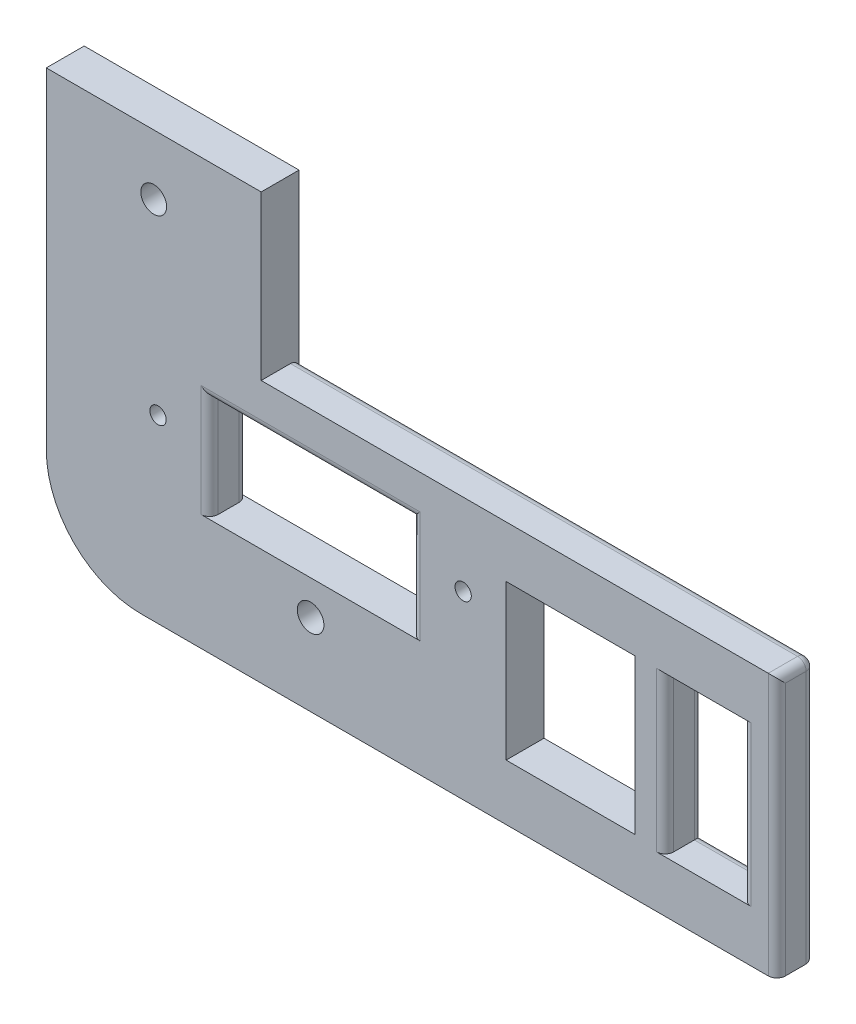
ISO-10303-21;
HEADER;
FILE_DESCRIPTION(('STEP AP214'),'2;1');
FILE_NAME('part.step','',(''),(''),'','','');
FILE_SCHEMA(('AUTOMOTIVE_DESIGN { 1 0 10303 214 1 1 1 1 }'));
ENDSEC;
DATA;
#1=APPLICATION_CONTEXT('core data for automotive mechanical design processes');
#2=APPLICATION_PROTOCOL_DEFINITION('international standard','automotive_design',2000,#1);
#3=PRODUCT_CONTEXT('',#1,'mechanical');
#4=PRODUCT('Part','Part','',(#3));
#5=PRODUCT_RELATED_PRODUCT_CATEGORY('part','',(#4));
#6=PRODUCT_DEFINITION_FORMATION('','',#4);
#7=PRODUCT_DEFINITION_CONTEXT('part definition',#1,'design');
#8=PRODUCT_DEFINITION('design','',#6,#7);
#9=PRODUCT_DEFINITION_SHAPE('','',#8);
#10=(LENGTH_UNIT() NAMED_UNIT(*) SI_UNIT(.MILLI.,.METRE.));
#11=(NAMED_UNIT(*) PLANE_ANGLE_UNIT() SI_UNIT($,.RADIAN.));
#12=(NAMED_UNIT(*) SI_UNIT($,.STERADIAN.) SOLID_ANGLE_UNIT());
#13=UNCERTAINTY_MEASURE_WITH_UNIT(LENGTH_MEASURE(1.E-05),#10,'distance_accuracy_value','');
#14=(GEOMETRIC_REPRESENTATION_CONTEXT(3) GLOBAL_UNCERTAINTY_ASSIGNED_CONTEXT((#13)) GLOBAL_UNIT_ASSIGNED_CONTEXT((#10,
#11,#12)) REPRESENTATION_CONTEXT('',''));
#15=CARTESIAN_POINT('',(0.,0.,0.));
#16=DIRECTION('',(0.,0.,1.));
#17=DIRECTION('',(1.,0.,0.));
#18=AXIS2_PLACEMENT_3D('',#15,#16,#17);
#19=CARTESIAN_POINT('',(-95.,30.5,0.));
#20=DIRECTION('',(0.,-1.,0.));
#21=DIRECTION('',(0.,0.,-1.));
#22=AXIS2_PLACEMENT_3D('',#19,#20,#21);
#23=PLANE('',#22);
#24=DIRECTION('',(0.,0.,-1.));
#25=VECTOR('',#24,1.);
#26=CARTESIAN_POINT('',(-107.5,30.5,0.));
#27=LINE('',#26,#25);
#28=CARTESIAN_POINT('',(-107.5,30.5,2.5));
#29=VERTEX_POINT('',#28);
#30=CARTESIAN_POINT('',(-107.5,30.5,-0.906654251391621));
#31=VERTEX_POINT('',#30);
#32=EDGE_CURVE('E60',#29,#31,#27,.T.);
#33=ORIENTED_EDGE('',*,*,#32,.F.);
#34=DIRECTION('',(-1.,0.,0.));
#35=VECTOR('',#34,1.);
#36=CARTESIAN_POINT('',(-57.5,30.5,2.5));
#37=LINE('',#36,#35);
#38=CARTESIAN_POINT('',(-48.5,30.5,2.5));
#39=VERTEX_POINT('',#38);
#40=EDGE_CURVE('E342',#39,#29,#37,.T.);
#41=ORIENTED_EDGE('',*,*,#40,.F.);
#42=DIRECTION('',(0.,0.,-1.));
#43=VECTOR('',#42,1.);
#44=CARTESIAN_POINT('',(-48.5,30.5,0.));
#45=LINE('',#44,#43);
#46=CARTESIAN_POINT('',(-48.5,30.5,-0.906654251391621));
#47=VERTEX_POINT('',#46);
#48=EDGE_CURVE('E667',#39,#47,#45,.T.);
#49=ORIENTED_EDGE('',*,*,#48,.T.);
#50=DIRECTION('',(1.,0.,0.));
#51=VECTOR('',#50,1.);
#52=CARTESIAN_POINT('',(-95.,30.5,-0.906654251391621));
#53=LINE('',#52,#51);
#54=EDGE_CURVE('E641',#47,#31,#53,.F.);
#55=ORIENTED_EDGE('',*,*,#54,.T.);
#56=EDGE_LOOP('',(#33,#41,#49,#55));
#57=FACE_BOUND('',#56,.T.);
#58=ADVANCED_FACE('F45',(#57),#23,.F.);
#59=CARTESIAN_POINT('',(-45.6471852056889,29.5,-0.906654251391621));
#60=DIRECTION('',(1.,0.,0.));
#61=DIRECTION('',(0.,0.,-1.));
#62=AXIS2_PLACEMENT_3D('',#59,#60,#61);
#63=CYLINDRICAL_SURFACE('',#62,1.);
#64=DIRECTION('',(1.,0.,0.));
#65=VECTOR('',#64,1.);
#66=CARTESIAN_POINT('',(-45.6471852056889,29.5,-1.90665425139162));
#67=LINE('',#66,#65);
#68=CARTESIAN_POINT('',(-107.5,29.5,-1.90665425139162));
#69=VERTEX_POINT('',#68);
#70=CARTESIAN_POINT('',(-48.5,29.5,-1.90665425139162));
#71=VERTEX_POINT('',#70);
#72=EDGE_CURVE('E67',#69,#71,#67,.T.);
#73=ORIENTED_EDGE('',*,*,#72,.F.);
#74=CARTESIAN_POINT('',(-107.5,29.5,-0.906654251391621));
#75=DIRECTION('',(-1.,0.,0.));
#76=DIRECTION('',(0.,0.,1.));
#77=AXIS2_PLACEMENT_3D('',#74,#75,#76);
#78=CIRCLE('',#77,1.);
#79=EDGE_CURVE('E11',#69,#31,#78,.F.);
#80=ORIENTED_EDGE('',*,*,#79,.T.);
#81=ORIENTED_EDGE('',*,*,#54,.F.);
#82=CARTESIAN_POINT('',(-48.5,29.5,-0.906654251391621));
#83=DIRECTION('',(1.,0.,0.));
#84=DIRECTION('',(0.,0.,-1.));
#85=AXIS2_PLACEMENT_3D('',#82,#83,#84);
#86=CIRCLE('',#85,1.);
#87=EDGE_CURVE('E643',#47,#71,#86,.F.);
#88=ORIENTED_EDGE('',*,*,#87,.T.);
#89=EDGE_LOOP('',(#73,#80,#81,#88));
#90=FACE_BOUND('',#89,.T.);
#91=ADVANCED_FACE('F779',(#90),#63,.T.);
#92=CARTESIAN_POINT('',(-47.5,24.5,-1.90665425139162));
#93=DIRECTION('',(0.,1.,0.));
#94=DIRECTION('',(0.,0.,1.));
#95=AXIS2_PLACEMENT_3D('',#92,#93,#94);
#96=PLANE('',#95);
#97=DIRECTION('',(0.,0.,-1.));
#98=VECTOR('',#97,1.);
#99=CARTESIAN_POINT('',(-60.5,24.5,-1.90665425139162));
#100=LINE('',#99,#98);
#101=CARTESIAN_POINT('',(-60.5,24.5,1.5));
#102=VERTEX_POINT('',#101);
#103=CARTESIAN_POINT('',(-60.5,24.5,-0.906654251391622));
#104=VERTEX_POINT('',#103);
#105=EDGE_CURVE('E381',#102,#104,#100,.T.);
#106=ORIENTED_EDGE('',*,*,#105,.T.);
#107=DIRECTION('',(-1.,0.,0.));
#108=VECTOR('',#107,1.);
#109=CARTESIAN_POINT('',(-47.5,24.5,-0.906654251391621));
#110=LINE('',#109,#108);
#111=CARTESIAN_POINT('',(-51.5,24.5,-0.906654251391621));
#112=VERTEX_POINT('',#111);
#113=EDGE_CURVE('E702',#104,#112,#110,.F.);
#114=ORIENTED_EDGE('',*,*,#113,.T.);
#115=DIRECTION('',(0.,0.,1.));
#116=VECTOR('',#115,1.);
#117=CARTESIAN_POINT('',(-51.5,24.5,-1.90665425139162));
#118=LINE('',#117,#116);
#119=CARTESIAN_POINT('',(-51.5,24.5,1.5));
#120=VERTEX_POINT('',#119);
#121=EDGE_CURVE('E388',#112,#120,#118,.T.);
#122=ORIENTED_EDGE('',*,*,#121,.T.);
#123=CARTESIAN_POINT('',(-50.5,24.5,1.5));
#124=DIRECTION('',(0.,1.,0.));
#125=DIRECTION('',(0.,0.,1.));
#126=AXIS2_PLACEMENT_3D('',#123,#124,#125);
#127=CIRCLE('',#126,1.);
#128=CARTESIAN_POINT('',(-50.5,24.5,2.5));
#129=VERTEX_POINT('',#128);
#130=EDGE_CURVE('E706',#120,#129,#127,.T.);
#131=ORIENTED_EDGE('',*,*,#130,.T.);
#132=DIRECTION('',(-1.,0.,0.));
#133=VECTOR('',#132,1.);
#134=CARTESIAN_POINT('',(-47.5,24.5,2.5));
#135=LINE('',#134,#133);
#136=CARTESIAN_POINT('',(-61.5,24.5,2.5));
#137=VERTEX_POINT('',#136);
#138=EDGE_CURVE('E391',#129,#137,#135,.T.);
#139=ORIENTED_EDGE('',*,*,#138,.T.);
#140=CARTESIAN_POINT('',(-61.5,24.5,1.5));
#141=DIRECTION('',(0.,1.,0.));
#142=DIRECTION('',(0.,0.,1.));
#143=AXIS2_PLACEMENT_3D('',#140,#141,#142);
#144=CIRCLE('',#143,1.);
#145=EDGE_CURVE('E53',#137,#102,#144,.T.);
#146=ORIENTED_EDGE('',*,*,#145,.T.);
#147=EDGE_LOOP('',(#106,#114,#122,#131,#139,#146));
#148=FACE_BOUND('',#147,.T.);
#149=ADVANCED_FACE('F761',(#148),#96,.F.);
#150=CARTESIAN_POINT('',(-47.5,6.00000000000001,-1.90665425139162));
#151=DIRECTION('',(0.,-1.,0.));
#152=DIRECTION('',(0.,0.,-1.));
#153=AXIS2_PLACEMENT_3D('',#150,#151,#152);
#154=PLANE('',#153);
#155=DIRECTION('',(0.,0.,-1.));
#156=VECTOR('',#155,1.);
#157=CARTESIAN_POINT('',(-51.5,6.00000000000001,2.4999999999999));
#158=LINE('',#157,#156);
#159=CARTESIAN_POINT('',(-51.5,6.00000000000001,1.5));
#160=VERTEX_POINT('',#159);
#161=CARTESIAN_POINT('',(-51.5,6.00000000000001,-0.906654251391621));
#162=VERTEX_POINT('',#161);
#163=EDGE_CURVE('E385',#160,#162,#158,.T.);
#164=ORIENTED_EDGE('',*,*,#163,.T.);
#165=DIRECTION('',(-1.,0.,0.));
#166=VECTOR('',#165,1.);
#167=CARTESIAN_POINT('',(-47.5,6.00000000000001,-0.906654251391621));
#168=LINE('',#167,#166);
#169=CARTESIAN_POINT('',(-60.5,6.00000000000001,-0.906654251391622));
#170=VERTEX_POINT('',#169);
#171=EDGE_CURVE('E669',#162,#170,#168,.T.);
#172=ORIENTED_EDGE('',*,*,#171,.T.);
#173=DIRECTION('',(0.,0.,1.));
#174=VECTOR('',#173,1.);
#175=CARTESIAN_POINT('',(-60.5,6.00000000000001,-1.90665425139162));
#176=LINE('',#175,#174);
#177=CARTESIAN_POINT('',(-60.5,6.00000000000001,1.5));
#178=VERTEX_POINT('',#177);
#179=EDGE_CURVE('E378',#170,#178,#176,.T.);
#180=ORIENTED_EDGE('',*,*,#179,.T.);
#181=CARTESIAN_POINT('',(-61.5,6.00000000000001,1.5));
#182=DIRECTION('',(0.,-1.,0.));
#183=DIRECTION('',(0.,0.,-1.));
#184=AXIS2_PLACEMENT_3D('',#181,#182,#183);
#185=CIRCLE('',#184,1.);
#186=CARTESIAN_POINT('',(-61.5,6.00000000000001,2.5));
#187=VERTEX_POINT('',#186);
#188=EDGE_CURVE('E709',#178,#187,#185,.T.);
#189=ORIENTED_EDGE('',*,*,#188,.T.);
#190=DIRECTION('',(-1.,0.,0.));
#191=VECTOR('',#190,1.);
#192=CARTESIAN_POINT('',(-47.5,6.00000000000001,2.4999999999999));
#193=LINE('',#192,#191);
#194=CARTESIAN_POINT('',(-50.5,6.00000000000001,2.5));
#195=VERTEX_POINT('',#194);
#196=EDGE_CURVE('E395',#195,#187,#193,.T.);
#197=ORIENTED_EDGE('',*,*,#196,.F.);
#198=CARTESIAN_POINT('',(-50.5,6.00000000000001,1.5));
#199=DIRECTION('',(0.,-1.,0.));
#200=DIRECTION('',(0.,0.,-1.));
#201=AXIS2_PLACEMENT_3D('',#198,#199,#200);
#202=CIRCLE('',#201,1.);
#203=EDGE_CURVE('E704',#195,#160,#202,.T.);
#204=ORIENTED_EDGE('',*,*,#203,.T.);
#205=EDGE_LOOP('',(#164,#172,#180,#189,#197,#204));
#206=FACE_BOUND('',#205,.T.);
#207=ADVANCED_FACE('F746',(#206),#154,.F.);
#208=CARTESIAN_POINT('',(-57.5,30.5,2.5));
#209=DIRECTION('',(0.,0.,-1.));
#210=DIRECTION('',(1.,0.,0.));
#211=AXIS2_PLACEMENT_3D('',#208,#209,#210);
#212=PLANE('',#211);
#213=CARTESIAN_POINT('',(-120.,42.5,2.5));
#214=DIRECTION('',(0.,0.,-1.));
#215=DIRECTION('',(-1.,0.,0.));
#216=AXIS2_PLACEMENT_3D('',#213,#214,#215);
#217=CIRCLE('',#216,1.5);
#218=CARTESIAN_POINT('',(-121.5,42.5,2.5));
#219=VERTEX_POINT('',#218);
#220=EDGE_CURVE('E363',#219,#219,#217,.F.);
#221=ORIENTED_EDGE('',*,*,#220,.F.);
#222=EDGE_LOOP('',(#221));
#223=FACE_BOUND('',#222,.T.);
#224=ORIENTED_EDGE('',*,*,#40,.T.);
#225=DIRECTION('',(0.,-1.,0.));
#226=VECTOR('',#225,1.);
#227=CARTESIAN_POINT('',(-107.5,49.5,2.5));
#228=LINE('',#227,#226);
#229=CARTESIAN_POINT('',(-107.5,49.5,2.5));
#230=VERTEX_POINT('',#229);
#231=EDGE_CURVE('E349',#230,#29,#228,.T.);
#232=ORIENTED_EDGE('',*,*,#231,.F.);
#233=DIRECTION('',(1.,0.,0.));
#234=VECTOR('',#233,1.);
#235=CARTESIAN_POINT('',(-132.5,49.5,2.5));
#236=LINE('',#235,#234);
#237=CARTESIAN_POINT('',(-132.5,49.5,2.5));
#238=VERTEX_POINT('',#237);
#239=EDGE_CURVE('E345',#238,#230,#236,.T.);
#240=ORIENTED_EDGE('',*,*,#239,.F.);
#241=DIRECTION('',(0.,-1.,0.));
#242=VECTOR('',#241,1.);
#243=CARTESIAN_POINT('',(-132.5,30.5,2.5));
#244=LINE('',#243,#242);
#245=CARTESIAN_POINT('',(-132.5,11.,2.5));
#246=VERTEX_POINT('',#245);
#247=EDGE_CURVE('E330',#238,#246,#244,.T.);
#248=ORIENTED_EDGE('',*,*,#247,.T.);
#249=CARTESIAN_POINT('',(-121.5,11.,2.5));
#250=DIRECTION('',(0.,0.,1.));
#251=DIRECTION('',(1.,0.,0.));
#252=AXIS2_PLACEMENT_3D('',#249,#250,#251);
#253=CIRCLE('',#252,11.);
#254=CARTESIAN_POINT('',(-121.5,0.,2.5));
#255=VERTEX_POINT('',#254);
#256=EDGE_CURVE('E433',#246,#255,#253,.T.);
#257=ORIENTED_EDGE('',*,*,#256,.T.);
#258=DIRECTION('',(-1.,0.,0.));
#259=VECTOR('',#258,1.);
#260=CARTESIAN_POINT('',(-57.5,0.,2.5));
#261=LINE('',#260,#259);
#262=CARTESIAN_POINT('',(-48.5,0.,2.5));
#263=VERTEX_POINT('',#262);
#264=EDGE_CURVE('E560',#263,#255,#261,.T.);
#265=ORIENTED_EDGE('',*,*,#264,.F.);
#266=DIRECTION('',(0.,1.,0.));
#267=VECTOR('',#266,1.);
#268=CARTESIAN_POINT('',(-48.5,30.5,2.5));
#269=LINE('',#268,#267);
#270=EDGE_CURVE('E659',#263,#39,#269,.T.);
#271=ORIENTED_EDGE('',*,*,#270,.T.);
#272=EDGE_LOOP('',(#224,#232,#240,#248,#257,#265,#271));
#273=FACE_BOUND('',#272,.T.);
#274=DIRECTION('',(0.,-1.,0.));
#275=VECTOR('',#274,1.);
#276=CARTESIAN_POINT('',(-79.,24.5,2.5));
#277=LINE('',#276,#275);
#278=CARTESIAN_POINT('',(-79.,24.5,2.5));
#279=VERTEX_POINT('',#278);
#280=CARTESIAN_POINT('',(-79.,6.5,2.5));
#281=VERTEX_POINT('',#280);
#282=EDGE_CURVE('E409',#279,#281,#277,.T.);
#283=ORIENTED_EDGE('',*,*,#282,.F.);
#284=DIRECTION('',(1.,0.,0.));
#285=VECTOR('',#284,1.);
#286=CARTESIAN_POINT('',(-79.,24.5,2.5));
#287=LINE('',#286,#285);
#288=CARTESIAN_POINT('',(-64.,24.5,2.5));
#289=VERTEX_POINT('',#288);
#290=EDGE_CURVE('E406',#279,#289,#287,.T.);
#291=ORIENTED_EDGE('',*,*,#290,.T.);
#292=DIRECTION('',(0.,-1.,0.));
#293=VECTOR('',#292,1.);
#294=CARTESIAN_POINT('',(-64.,24.5,2.5));
#295=LINE('',#294,#293);
#296=CARTESIAN_POINT('',(-64.,6.5,2.5));
#297=VERTEX_POINT('',#296);
#298=EDGE_CURVE('E402',#289,#297,#295,.T.);
#299=ORIENTED_EDGE('',*,*,#298,.T.);
#300=DIRECTION('',(1.,0.,0.));
#301=VECTOR('',#300,1.);
#302=CARTESIAN_POINT('',(-79.,6.5,2.5));
#303=LINE('',#302,#301);
#304=EDGE_CURVE('E399',#281,#297,#303,.T.);
#305=ORIENTED_EDGE('',*,*,#304,.F.);
#306=EDGE_LOOP('',(#283,#291,#299,#305));
#307=FACE_BOUND('',#306,.T.);
#308=DIRECTION('',(1.,0.,0.));
#309=VECTOR('',#308,1.);
#310=CARTESIAN_POINT('',(-95.,13.5,2.5));
#311=LINE('',#310,#309);
#312=CARTESIAN_POINT('',(-114.5,13.5,2.5));
#313=VERTEX_POINT('',#312);
#314=CARTESIAN_POINT('',(-89.,13.5,2.5));
#315=VERTEX_POINT('',#314);
#316=EDGE_CURVE('E437',#313,#315,#311,.T.);
#317=ORIENTED_EDGE('',*,*,#316,.F.);
#318=DIRECTION('',(0.,-1.,0.));
#319=VECTOR('',#318,1.);
#320=CARTESIAN_POINT('',(-114.5,30.5,2.5));
#321=LINE('',#320,#319);
#322=CARTESIAN_POINT('',(-114.5,26.5,2.5));
#323=VERTEX_POINT('',#322);
#324=EDGE_CURVE('E578',#323,#313,#321,.T.);
#325=ORIENTED_EDGE('',*,*,#324,.F.);
#326=DIRECTION('',(1.,0.,0.));
#327=VECTOR('',#326,1.);
#328=CARTESIAN_POINT('',(-113.5,26.5,2.5));
#329=LINE('',#328,#327);
#330=CARTESIAN_POINT('',(-89.,26.5,2.5));
#331=VERTEX_POINT('',#330);
#332=EDGE_CURVE('E581',#331,#323,#329,.F.);
#333=ORIENTED_EDGE('',*,*,#332,.F.);
#334=DIRECTION('',(0.,-1.,0.));
#335=VECTOR('',#334,1.);
#336=CARTESIAN_POINT('',(-89.,25.5,2.5));
#337=LINE('',#336,#335);
#338=EDGE_CURVE('E584',#315,#331,#337,.F.);
#339=ORIENTED_EDGE('',*,*,#338,.F.);
#340=EDGE_LOOP('',(#317,#325,#333,#339));
#341=FACE_BOUND('',#340,.T.);
#342=CARTESIAN_POINT('',(-101.75,9.5,2.5));
#343=DIRECTION('',(0.,0.,1.));
#344=DIRECTION('',(1.,0.,0.));
#345=AXIS2_PLACEMENT_3D('',#342,#343,#344);
#346=CIRCLE('',#345,1.55);
#347=CARTESIAN_POINT('',(-100.2,9.5,2.5));
#348=VERTEX_POINT('',#347);
#349=EDGE_CURVE('E448',#348,#348,#346,.T.);
#350=ORIENTED_EDGE('',*,*,#349,.F.);
#351=EDGE_LOOP('',(#350));
#352=FACE_BOUND('',#351,.T.);
#353=CARTESIAN_POINT('',(-119.5,21.,2.5));
#354=DIRECTION('',(0.,0.,-1.));
#355=DIRECTION('',(-1.,0.,0.));
#356=AXIS2_PLACEMENT_3D('',#353,#354,#355);
#357=CIRCLE('',#356,0.950000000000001);
#358=CARTESIAN_POINT('',(-120.45,21.,2.5));
#359=VERTEX_POINT('',#358);
#360=EDGE_CURVE('E557',#359,#359,#357,.T.);
#361=ORIENTED_EDGE('',*,*,#360,.T.);
#362=EDGE_LOOP('',(#361));
#363=FACE_BOUND('',#362,.T.);
#364=CARTESIAN_POINT('',(-84.,21.,2.5));
#365=DIRECTION('',(0.,0.,-1.));
#366=DIRECTION('',(-1.,0.,0.));
#367=AXIS2_PLACEMENT_3D('',#364,#365,#366);
#368=CIRCLE('',#367,0.950000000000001);
#369=CARTESIAN_POINT('',(-84.95,21.,2.5));
#370=VERTEX_POINT('',#369);
#371=EDGE_CURVE('E561',#370,#370,#368,.T.);
#372=ORIENTED_EDGE('',*,*,#371,.T.);
#373=EDGE_LOOP('',(#372));
#374=FACE_BOUND('',#373,.T.);
#375=DIRECTION('',(0.,-1.,0.));
#376=VECTOR('',#375,1.);
#377=CARTESIAN_POINT('',(-50.5,30.5,2.5));
#378=LINE('',#377,#376);
#379=EDGE_CURVE('E690',#129,#195,#378,.T.);
#380=ORIENTED_EDGE('',*,*,#379,.T.);
#381=ORIENTED_EDGE('',*,*,#196,.T.);
#382=DIRECTION('',(0.,-1.,0.));
#383=VECTOR('',#382,1.);
#384=CARTESIAN_POINT('',(-61.5,30.5,2.5));
#385=LINE('',#384,#383);
#386=EDGE_CURVE('E687',#187,#137,#385,.F.);
#387=ORIENTED_EDGE('',*,*,#386,.T.);
#388=ORIENTED_EDGE('',*,*,#138,.F.);
#389=EDGE_LOOP('',(#380,#381,#387,#388));
#390=FACE_BOUND('',#389,.T.);
#391=ADVANCED_FACE('F346',(#223,#273,#307,#341,#352,#363,#374,#390),#212,.F.);
#392=CARTESIAN_POINT('',(-45.6471852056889,50.,-1.90665425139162));
#393=DIRECTION('',(0.,0.,1.));
#394=DIRECTION('',(-1.,0.,0.));
#395=AXIS2_PLACEMENT_3D('',#392,#393,#394);
#396=PLANE('',#395);
#397=CARTESIAN_POINT('',(-120.,42.5,-1.90665425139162));
#398=DIRECTION('',(0.,0.,-1.));
#399=DIRECTION('',(-1.,0.,0.));
#400=AXIS2_PLACEMENT_3D('',#397,#398,#399);
#401=CIRCLE('',#400,1.5);
#402=CARTESIAN_POINT('',(-121.5,42.5,-1.90665425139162));
#403=VERTEX_POINT('',#402);
#404=EDGE_CURVE('E888',#403,#403,#401,.T.);
#405=ORIENTED_EDGE('',*,*,#404,.F.);
#406=EDGE_LOOP('',(#405));
#407=FACE_BOUND('',#406,.T.);
#408=DIRECTION('',(0.,-1.,0.));
#409=VECTOR('',#408,1.);
#410=CARTESIAN_POINT('',(-61.5,50.,-1.90665425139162));
#411=LINE('',#410,#409);
#412=CARTESIAN_POINT('',(-61.5,25.5,-1.90665425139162));
#413=VERTEX_POINT('',#412);
#414=CARTESIAN_POINT('',(-61.5,5.00000000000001,-1.90665425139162));
#415=VERTEX_POINT('',#414);
#416=EDGE_CURVE('E680',#413,#415,#411,.T.);
#417=ORIENTED_EDGE('',*,*,#416,.T.);
#418=DIRECTION('',(-1.,0.,0.));
#419=VECTOR('',#418,1.);
#420=CARTESIAN_POINT('',(-45.6471852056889,5.,-1.90665425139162));
#421=LINE('',#420,#419);
#422=CARTESIAN_POINT('',(-50.5,5.00000000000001,-1.90665425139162));
#423=VERTEX_POINT('',#422);
#424=EDGE_CURVE('E684',#415,#423,#421,.F.);
#425=ORIENTED_EDGE('',*,*,#424,.T.);
#426=DIRECTION('',(0.,-1.,0.));
#427=VECTOR('',#426,1.);
#428=CARTESIAN_POINT('',(-50.5,50.,-1.90665425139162));
#429=LINE('',#428,#427);
#430=CARTESIAN_POINT('',(-50.5,25.5,-1.90665425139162));
#431=VERTEX_POINT('',#430);
#432=EDGE_CURVE('E682',#423,#431,#429,.F.);
#433=ORIENTED_EDGE('',*,*,#432,.T.);
#434=DIRECTION('',(-1.,0.,0.));
#435=VECTOR('',#434,1.);
#436=CARTESIAN_POINT('',(-45.6471852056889,25.5,-1.90665425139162));
#437=LINE('',#436,#435);
#438=EDGE_CURVE('E678',#431,#413,#437,.T.);
#439=ORIENTED_EDGE('',*,*,#438,.T.);
#440=EDGE_LOOP('',(#417,#425,#433,#439));
#441=FACE_BOUND('',#440,.T.);
#442=DIRECTION('',(1.,0.,0.));
#443=VECTOR('',#442,1.);
#444=CARTESIAN_POINT('',(-121.5,1.,-1.90665425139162));
#445=LINE('',#444,#443);
#446=CARTESIAN_POINT('',(-48.5,1.,-1.90665425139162));
#447=VERTEX_POINT('',#446);
#448=CARTESIAN_POINT('',(-121.5,1.,-1.90665425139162));
#449=VERTEX_POINT('',#448);
#450=EDGE_CURVE('E627',#447,#449,#445,.F.);
#451=ORIENTED_EDGE('',*,*,#450,.T.);
#452=CARTESIAN_POINT('',(-121.5,11.,-1.90665425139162));
#453=DIRECTION('',(0.,0.,1.));
#454=DIRECTION('',(1.,0.,0.));
#455=AXIS2_PLACEMENT_3D('',#452,#453,#454);
#456=CIRCLE('',#455,10.);
#457=CARTESIAN_POINT('',(-131.5,11.,-1.90665425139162));
#458=VERTEX_POINT('',#457);
#459=EDGE_CURVE('E632',#449,#458,#456,.F.);
#460=ORIENTED_EDGE('',*,*,#459,.T.);
#461=DIRECTION('',(0.,-1.,0.));
#462=VECTOR('',#461,1.);
#463=CARTESIAN_POINT('',(-131.5,50.,-1.90665425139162));
#464=LINE('',#463,#462);
#465=CARTESIAN_POINT('',(-131.5,29.5,-1.90665425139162));
#466=VERTEX_POINT('',#465);
#467=EDGE_CURVE('E629',#458,#466,#464,.F.);
#468=ORIENTED_EDGE('',*,*,#467,.T.);
#469=DIRECTION('',(-1.,0.,0.));
#470=VECTOR('',#469,1.);
#471=CARTESIAN_POINT('',(-132.5,29.5,-1.90665425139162));
#472=LINE('',#471,#470);
#473=CARTESIAN_POINT('',(-132.5,29.5,-1.90665425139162));
#474=VERTEX_POINT('',#473);
#475=EDGE_CURVE('E358',#466,#474,#472,.T.);
#476=ORIENTED_EDGE('',*,*,#475,.T.);
#477=DIRECTION('',(0.,-1.,0.));
#478=VECTOR('',#477,1.);
#479=CARTESIAN_POINT('',(-132.5,49.5,-1.90665425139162));
#480=LINE('',#479,#478);
#481=CARTESIAN_POINT('',(-132.5,49.5,-1.90665425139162));
#482=VERTEX_POINT('',#481);
#483=EDGE_CURVE('E368',#482,#474,#480,.T.);
#484=ORIENTED_EDGE('',*,*,#483,.F.);
#485=DIRECTION('',(-1.,0.,0.));
#486=VECTOR('',#485,1.);
#487=CARTESIAN_POINT('',(-132.5,49.5,-1.90665425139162));
#488=LINE('',#487,#486);
#489=CARTESIAN_POINT('',(-107.5,49.5,-1.90665425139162));
#490=VERTEX_POINT('',#489);
#491=EDGE_CURVE('E356',#490,#482,#488,.T.);
#492=ORIENTED_EDGE('',*,*,#491,.F.);
#493=DIRECTION('',(0.,-1.,0.));
#494=VECTOR('',#493,1.);
#495=CARTESIAN_POINT('',(-107.5,49.5,-1.90665425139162));
#496=LINE('',#495,#494);
#497=EDGE_CURVE('E372',#490,#69,#496,.T.);
#498=ORIENTED_EDGE('',*,*,#497,.T.);
#499=ORIENTED_EDGE('',*,*,#72,.T.);
#500=DIRECTION('',(0.,-1.,0.));
#501=VECTOR('',#500,1.);
#502=CARTESIAN_POINT('',(-48.5,50.,-1.90665425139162));
#503=LINE('',#502,#501);
#504=EDGE_CURVE('E625',#71,#447,#503,.T.);
#505=ORIENTED_EDGE('',*,*,#504,.T.);
#506=EDGE_LOOP('',(#451,#460,#468,#476,#484,#492,#498,#499,#505));
#507=FACE_BOUND('',#506,.T.);
#508=DIRECTION('',(-1.,0.,0.));
#509=VECTOR('',#508,1.);
#510=CARTESIAN_POINT('',(-82.8164319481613,23.05,-1.90665425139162));
#511=LINE('',#510,#509);
#512=CARTESIAN_POINT('',(-82.8164319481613,23.05,-1.90665425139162));
#513=VERTEX_POINT('',#512);
#514=CARTESIAN_POINT('',(-85.1835680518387,23.05,-1.90665425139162));
#515=VERTEX_POINT('',#514);
#516=EDGE_CURVE('E536',#513,#515,#511,.T.);
#517=ORIENTED_EDGE('',*,*,#516,.T.);
#518=DIRECTION('',(-0.5,-0.866025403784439,0.));
#519=VECTOR('',#518,1.);
#520=CARTESIAN_POINT('',(-85.1835680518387,23.05,-1.90665425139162));
#521=LINE('',#520,#519);
#522=CARTESIAN_POINT('',(-86.3671361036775,21.,-1.90665425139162));
#523=VERTEX_POINT('',#522);
#524=EDGE_CURVE('E533',#515,#523,#521,.T.);
#525=ORIENTED_EDGE('',*,*,#524,.T.);
#526=DIRECTION('',(0.499999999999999,-0.866025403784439,0.));
#527=VECTOR('',#526,1.);
#528=CARTESIAN_POINT('',(-86.3671361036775,21.,-1.90665425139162));
#529=LINE('',#528,#527);
#530=CARTESIAN_POINT('',(-85.1835680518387,18.95,-1.90665425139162));
#531=VERTEX_POINT('',#530);
#532=EDGE_CURVE('E530',#523,#531,#529,.T.);
#533=ORIENTED_EDGE('',*,*,#532,.T.);
#534=DIRECTION('',(1.,0.,0.));
#535=VECTOR('',#534,1.);
#536=CARTESIAN_POINT('',(-85.1835680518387,18.95,-1.90665425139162));
#537=LINE('',#536,#535);
#538=CARTESIAN_POINT('',(-82.8164319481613,18.95,-1.90665425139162));
#539=VERTEX_POINT('',#538);
#540=EDGE_CURVE('E526',#531,#539,#537,.T.);
#541=ORIENTED_EDGE('',*,*,#540,.T.);
#542=DIRECTION('',(0.5,0.866025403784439,0.));
#543=VECTOR('',#542,1.);
#544=CARTESIAN_POINT('',(-82.8164319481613,18.95,-1.90665425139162));
#545=LINE('',#544,#543);
#546=CARTESIAN_POINT('',(-81.6328638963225,21.,-1.90665425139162));
#547=VERTEX_POINT('',#546);
#548=EDGE_CURVE('E523',#539,#547,#545,.T.);
#549=ORIENTED_EDGE('',*,*,#548,.T.);
#550=DIRECTION('',(-0.499999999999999,0.866025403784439,0.));
#551=VECTOR('',#550,1.);
#552=CARTESIAN_POINT('',(-81.6328638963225,21.,-1.90665425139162));
#553=LINE('',#552,#551);
#554=EDGE_CURVE('E484',#547,#513,#553,.T.);
#555=ORIENTED_EDGE('',*,*,#554,.T.);
#556=EDGE_LOOP('',(#517,#525,#533,#541,#549,#555));
#557=FACE_BOUND('',#556,.T.);
#558=DIRECTION('',(-1.,0.,0.));
#559=VECTOR('',#558,1.);
#560=CARTESIAN_POINT('',(-118.316431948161,23.05,-1.90665425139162));
#561=LINE('',#560,#559);
#562=CARTESIAN_POINT('',(-118.316431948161,23.05,-1.90665425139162));
#563=VERTEX_POINT('',#562);
#564=CARTESIAN_POINT('',(-120.683568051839,23.05,-1.90665425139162));
#565=VERTEX_POINT('',#564);
#566=EDGE_CURVE('E483',#563,#565,#561,.T.);
#567=ORIENTED_EDGE('',*,*,#566,.T.);
#568=DIRECTION('',(-0.5,-0.866025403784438,0.));
#569=VECTOR('',#568,1.);
#570=CARTESIAN_POINT('',(-120.683568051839,23.05,-1.90665425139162));
#571=LINE('',#570,#569);
#572=CARTESIAN_POINT('',(-121.867136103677,21.,-1.90665425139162));
#573=VERTEX_POINT('',#572);
#574=EDGE_CURVE('E487',#565,#573,#571,.T.);
#575=ORIENTED_EDGE('',*,*,#574,.T.);
#576=DIRECTION('',(0.5,-0.866025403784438,0.));
#577=VECTOR('',#576,1.);
#578=CARTESIAN_POINT('',(-121.867136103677,21.,-1.90665425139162));
#579=LINE('',#578,#577);
#580=CARTESIAN_POINT('',(-120.683568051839,18.95,-1.90665425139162));
#581=VERTEX_POINT('',#580);
#582=EDGE_CURVE('E490',#573,#581,#579,.T.);
#583=ORIENTED_EDGE('',*,*,#582,.T.);
#584=DIRECTION('',(1.,0.,0.));
#585=VECTOR('',#584,1.);
#586=CARTESIAN_POINT('',(-120.683568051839,18.95,-1.90665425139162));
#587=LINE('',#586,#585);
#588=CARTESIAN_POINT('',(-118.316431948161,18.95,-1.90665425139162));
#589=VERTEX_POINT('',#588);
#590=EDGE_CURVE('E493',#581,#589,#587,.T.);
#591=ORIENTED_EDGE('',*,*,#590,.T.);
#592=DIRECTION('',(0.5,0.866025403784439,0.));
#593=VECTOR('',#592,1.);
#594=CARTESIAN_POINT('',(-118.316431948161,18.95,-1.90665425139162));
#595=LINE('',#594,#593);
#596=CARTESIAN_POINT('',(-117.132863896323,21.,-1.90665425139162));
#597=VERTEX_POINT('',#596);
#598=EDGE_CURVE('E464',#589,#597,#595,.T.);
#599=ORIENTED_EDGE('',*,*,#598,.T.);
#600=DIRECTION('',(-0.5,0.866025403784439,0.));
#601=VECTOR('',#600,1.);
#602=CARTESIAN_POINT('',(-117.132863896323,21.,-1.90665425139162));
#603=LINE('',#602,#601);
#604=EDGE_CURVE('E480',#597,#563,#603,.T.);
#605=ORIENTED_EDGE('',*,*,#604,.T.);
#606=EDGE_LOOP('',(#567,#575,#583,#591,#599,#605));
#607=FACE_BOUND('',#606,.T.);
#608=CARTESIAN_POINT('',(-101.75,9.5,-1.90665425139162));
#609=DIRECTION('',(0.,0.,-1.));
#610=DIRECTION('',(-1.,0.,0.));
#611=AXIS2_PLACEMENT_3D('',#608,#609,#610);
#612=CIRCLE('',#611,1.55);
#613=CARTESIAN_POINT('',(-103.3,9.5,-1.90665425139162));
#614=VERTEX_POINT('',#613);
#615=EDGE_CURVE('E459',#614,#614,#612,.T.);
#616=ORIENTED_EDGE('',*,*,#615,.F.);
#617=EDGE_LOOP('',(#616));
#618=FACE_BOUND('',#617,.T.);
#619=DIRECTION('',(1.,0.,0.));
#620=VECTOR('',#619,1.);
#621=CARTESIAN_POINT('',(-95.,13.5,-1.90665425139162));
#622=LINE('',#621,#620);
#623=CARTESIAN_POINT('',(-114.5,13.5,-1.90665425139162));
#624=VERTEX_POINT('',#623);
#625=CARTESIAN_POINT('',(-89.,13.5,-1.90665425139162));
#626=VERTEX_POINT('',#625);
#627=EDGE_CURVE('E441',#624,#626,#622,.T.);
#628=ORIENTED_EDGE('',*,*,#627,.T.);
#629=DIRECTION('',(0.,-1.,0.));
#630=VECTOR('',#629,1.);
#631=CARTESIAN_POINT('',(-89.,13.5,-1.90665425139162));
#632=LINE('',#631,#630);
#633=CARTESIAN_POINT('',(-89.,26.5,-1.90665425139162));
#634=VERTEX_POINT('',#633);
#635=EDGE_CURVE('E598',#634,#626,#632,.T.);
#636=ORIENTED_EDGE('',*,*,#635,.F.);
#637=DIRECTION('',(1.,0.,0.));
#638=VECTOR('',#637,1.);
#639=CARTESIAN_POINT('',(-90.,26.5,-1.90665425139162));
#640=LINE('',#639,#638);
#641=CARTESIAN_POINT('',(-114.5,26.5,-1.90665425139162));
#642=VERTEX_POINT('',#641);
#643=EDGE_CURVE('E601',#642,#634,#640,.T.);
#644=ORIENTED_EDGE('',*,*,#643,.F.);
#645=DIRECTION('',(0.,-1.,0.));
#646=VECTOR('',#645,1.);
#647=CARTESIAN_POINT('',(-114.5,50.,-1.90665425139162));
#648=LINE('',#647,#646);
#649=EDGE_CURVE('E604',#624,#642,#648,.F.);
#650=ORIENTED_EDGE('',*,*,#649,.F.);
#651=EDGE_LOOP('',(#628,#636,#644,#650));
#652=FACE_BOUND('',#651,.T.);
#653=DIRECTION('',(0.,-1.,0.));
#654=VECTOR('',#653,1.);
#655=CARTESIAN_POINT('',(-64.,24.5,-1.90665425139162));
#656=LINE('',#655,#654);
#657=CARTESIAN_POINT('',(-64.,24.5,-1.90665425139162));
#658=VERTEX_POINT('',#657);
#659=CARTESIAN_POINT('',(-64.,6.5,-1.90665425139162));
#660=VERTEX_POINT('',#659);
#661=EDGE_CURVE('E415',#658,#660,#656,.T.);
#662=ORIENTED_EDGE('',*,*,#661,.F.);
#663=DIRECTION('',(1.,0.,0.));
#664=VECTOR('',#663,1.);
#665=CARTESIAN_POINT('',(-79.,24.5,-1.90665425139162));
#666=LINE('',#665,#664);
#667=CARTESIAN_POINT('',(-79.,24.5,-1.90665425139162));
#668=VERTEX_POINT('',#667);
#669=EDGE_CURVE('E418',#668,#658,#666,.T.);
#670=ORIENTED_EDGE('',*,*,#669,.F.);
#671=DIRECTION('',(0.,-1.,0.));
#672=VECTOR('',#671,1.);
#673=CARTESIAN_POINT('',(-79.,24.5,-1.90665425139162));
#674=LINE('',#673,#672);
#675=CARTESIAN_POINT('',(-79.,6.5,-1.90665425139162));
#676=VERTEX_POINT('',#675);
#677=EDGE_CURVE('E403',#668,#676,#674,.T.);
#678=ORIENTED_EDGE('',*,*,#677,.T.);
#679=DIRECTION('',(1.,0.,0.));
#680=VECTOR('',#679,1.);
#681=CARTESIAN_POINT('',(-79.,6.5,-1.90665425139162));
#682=LINE('',#681,#680);
#683=EDGE_CURVE('E397',#676,#660,#682,.T.);
#684=ORIENTED_EDGE('',*,*,#683,.T.);
#685=EDGE_LOOP('',(#662,#670,#678,#684));
#686=FACE_BOUND('',#685,.T.);
#687=ADVANCED_FACE('F732',(#407,#441,#507,#557,#607,#618,#652,#686),#396,.F.);
#688=CARTESIAN_POINT('',(-84.,21.,-7.5));
#689=DIRECTION('',(0.,0.,1.));
#690=DIRECTION('',(-1.,0.,0.));
#691=AXIS2_PLACEMENT_3D('',#688,#689,#690);
#692=CYLINDRICAL_SURFACE('',#691,0.950000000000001);
#693=ORIENTED_EDGE('',*,*,#371,.F.);
#694=EDGE_LOOP('',(#693));
#695=FACE_BOUND('',#694,.T.);
#696=CARTESIAN_POINT('',(-84.,21.,0.0933457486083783));
#697=DIRECTION('',(0.,0.,1.));
#698=DIRECTION('',(1.,0.,0.));
#699=AXIS2_PLACEMENT_3D('',#696,#697,#698);
#700=CIRCLE('',#699,0.950000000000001);
#701=CARTESIAN_POINT('',(-83.05,21.,0.0933457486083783));
#702=VERTEX_POINT('',#701);
#703=EDGE_CURVE('E564',#702,#702,#700,.F.);
#704=ORIENTED_EDGE('',*,*,#703,.T.);
#705=EDGE_LOOP('',(#704));
#706=FACE_BOUND('',#705,.T.);
#707=ADVANCED_FACE('F788',(#695,#706),#692,.F.);
#708=CARTESIAN_POINT('',(-119.5,21.,-7.5));
#709=DIRECTION('',(0.,0.,1.));
#710=DIRECTION('',(-1.,0.,0.));
#711=AXIS2_PLACEMENT_3D('',#708,#709,#710);
#712=CYLINDRICAL_SURFACE('',#711,0.950000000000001);
#713=ORIENTED_EDGE('',*,*,#360,.F.);
#714=EDGE_LOOP('',(#713));
#715=FACE_BOUND('',#714,.T.);
#716=CARTESIAN_POINT('',(-119.5,21.,0.0933457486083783));
#717=DIRECTION('',(0.,0.,1.));
#718=DIRECTION('',(1.,0.,0.));
#719=AXIS2_PLACEMENT_3D('',#716,#717,#718);
#720=CIRCLE('',#719,0.950000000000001);
#721=CARTESIAN_POINT('',(-118.55,21.,0.0933457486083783));
#722=VERTEX_POINT('',#721);
#723=EDGE_CURVE('E500',#722,#722,#720,.F.);
#724=ORIENTED_EDGE('',*,*,#723,.T.);
#725=EDGE_LOOP('',(#724));
#726=FACE_BOUND('',#725,.T.);
#727=ADVANCED_FACE('F793',(#715,#726),#712,.F.);
#728=CARTESIAN_POINT('',(-95.,0.,0.));
#729=DIRECTION('',(0.,-1.,0.));
#730=DIRECTION('',(0.,0.,-1.));
#731=AXIS2_PLACEMENT_3D('',#728,#729,#730);
#732=PLANE('',#731);
#733=DIRECTION('',(0.,0.,1.));
#734=VECTOR('',#733,1.);
#735=CARTESIAN_POINT('',(-47.5,0.,-1.90665425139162));
#736=LINE('',#735,#734);
#737=CARTESIAN_POINT('',(-47.5,0.,-0.906654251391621));
#738=VERTEX_POINT('',#737);
#739=CARTESIAN_POINT('',(-47.5,0.,1.5));
#740=VERTEX_POINT('',#739);
#741=EDGE_CURVE('E392',#738,#740,#736,.T.);
#742=ORIENTED_EDGE('',*,*,#741,.T.);
#743=CARTESIAN_POINT('',(-48.5,0.,1.5));
#744=DIRECTION('',(0.,-1.,0.));
#745=DIRECTION('',(0.,0.,-1.));
#746=AXIS2_PLACEMENT_3D('',#743,#744,#745);
#747=CIRCLE('',#746,1.);
#748=EDGE_CURVE('E665',#740,#263,#747,.T.);
#749=ORIENTED_EDGE('',*,*,#748,.T.);
#750=ORIENTED_EDGE('',*,*,#264,.T.);
#751=DIRECTION('',(0.,0.,-1.));
#752=VECTOR('',#751,1.);
#753=CARTESIAN_POINT('',(-121.5,0.,8.09334574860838));
#754=LINE('',#753,#752);
#755=CARTESIAN_POINT('',(-121.5,0.,-0.906654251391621));
#756=VERTEX_POINT('',#755);
#757=EDGE_CURVE('E430',#255,#756,#754,.T.);
#758=ORIENTED_EDGE('',*,*,#757,.T.);
#759=DIRECTION('',(1.,0.,0.));
#760=VECTOR('',#759,1.);
#761=CARTESIAN_POINT('',(-47.5,0.,-0.906654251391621));
#762=LINE('',#761,#760);
#763=EDGE_CURVE('E636',#756,#738,#762,.T.);
#764=ORIENTED_EDGE('',*,*,#763,.T.);
#765=EDGE_LOOP('',(#742,#749,#750,#758,#764));
#766=FACE_BOUND('',#765,.T.);
#767=ADVANCED_FACE('F790',(#766),#732,.T.);
#768=CARTESIAN_POINT('',(-132.5,30.5,2.5));
#769=DIRECTION('',(1.,0.,0.));
#770=DIRECTION('',(0.,0.,1.));
#771=AXIS2_PLACEMENT_3D('',#768,#769,#770);
#772=PLANE('',#771);
#773=ORIENTED_EDGE('',*,*,#247,.F.);
#774=DIRECTION('',(0.,0.,1.));
#775=VECTOR('',#774,1.);
#776=CARTESIAN_POINT('',(-132.5,49.5,2.5));
#777=LINE('',#776,#775);
#778=EDGE_CURVE('E335',#482,#238,#777,.T.);
#779=ORIENTED_EDGE('',*,*,#778,.F.);
#780=ORIENTED_EDGE('',*,*,#483,.T.);
#781=DIRECTION('',(0.,0.,1.));
#782=VECTOR('',#781,1.);
#783=CARTESIAN_POINT('',(-132.5,29.5,2.5));
#784=LINE('',#783,#782);
#785=CARTESIAN_POINT('',(-132.5,29.5,-0.906654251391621));
#786=VERTEX_POINT('',#785);
#787=EDGE_CURVE('E360',#474,#786,#784,.T.);
#788=ORIENTED_EDGE('',*,*,#787,.T.);
#789=DIRECTION('',(0.,-1.,0.));
#790=VECTOR('',#789,1.);
#791=CARTESIAN_POINT('',(-132.5,30.5,-0.906654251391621));
#792=LINE('',#791,#790);
#793=CARTESIAN_POINT('',(-132.5,11.,-0.906654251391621));
#794=VERTEX_POINT('',#793);
#795=EDGE_CURVE('E616',#786,#794,#792,.T.);
#796=ORIENTED_EDGE('',*,*,#795,.T.);
#797=DIRECTION('',(0.,0.,-1.));
#798=VECTOR('',#797,1.);
#799=CARTESIAN_POINT('',(-132.5,11.,8.09334574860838));
#800=LINE('',#799,#798);
#801=EDGE_CURVE('E337',#246,#794,#800,.T.);
#802=ORIENTED_EDGE('',*,*,#801,.F.);
#803=EDGE_LOOP('',(#773,#779,#780,#788,#796,#802));
#804=FACE_BOUND('',#803,.T.);
#805=ADVANCED_FACE('F332',(#804),#772,.F.);
#806=CARTESIAN_POINT('',(-95.,0.,0.0933457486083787));
#807=DIRECTION('',(0.,0.,-1.));
#808=DIRECTION('',(1.,0.,0.));
#809=AXIS2_PLACEMENT_3D('',#806,#807,#808);
#810=PLANE('',#809);
#811=DIRECTION('',(-0.499999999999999,0.866025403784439,0.));
#812=VECTOR('',#811,1.);
#813=CARTESIAN_POINT('',(-81.6328638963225,21.,0.0933457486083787));
#814=LINE('',#813,#812);
#815=CARTESIAN_POINT('',(-81.6328638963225,21.,0.0933457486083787));
#816=VERTEX_POINT('',#815);
#817=CARTESIAN_POINT('',(-82.8164319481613,23.05,0.0933457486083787));
#818=VERTEX_POINT('',#817);
#819=EDGE_CURVE('E527',#816,#818,#814,.T.);
#820=ORIENTED_EDGE('',*,*,#819,.F.);
#821=DIRECTION('',(0.5,0.866025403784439,0.));
#822=VECTOR('',#821,1.);
#823=CARTESIAN_POINT('',(-82.8164319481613,18.95,0.0933457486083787));
#824=LINE('',#823,#822);
#825=CARTESIAN_POINT('',(-82.8164319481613,18.95,0.0933457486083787));
#826=VERTEX_POINT('',#825);
#827=EDGE_CURVE('E512',#826,#816,#824,.T.);
#828=ORIENTED_EDGE('',*,*,#827,.F.);
#829=DIRECTION('',(1.,0.,0.));
#830=VECTOR('',#829,1.);
#831=CARTESIAN_POINT('',(-85.1835680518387,18.95,0.0933457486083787));
#832=LINE('',#831,#830);
#833=CARTESIAN_POINT('',(-85.1835680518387,18.95,0.0933457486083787));
#834=VERTEX_POINT('',#833);
#835=EDGE_CURVE('E543',#834,#826,#832,.T.);
#836=ORIENTED_EDGE('',*,*,#835,.F.);
#837=DIRECTION('',(0.499999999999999,-0.866025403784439,0.));
#838=VECTOR('',#837,1.);
#839=CARTESIAN_POINT('',(-86.3671361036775,21.,0.0933457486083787));
#840=LINE('',#839,#838);
#841=CARTESIAN_POINT('',(-86.3671361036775,21.,0.0933457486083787));
#842=VERTEX_POINT('',#841);
#843=EDGE_CURVE('E546',#842,#834,#840,.T.);
#844=ORIENTED_EDGE('',*,*,#843,.F.);
#845=DIRECTION('',(-0.5,-0.866025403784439,0.));
#846=VECTOR('',#845,1.);
#847=CARTESIAN_POINT('',(-85.1835680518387,23.05,0.0933457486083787));
#848=LINE('',#847,#846);
#849=CARTESIAN_POINT('',(-85.1835680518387,23.05,0.0933457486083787));
#850=VERTEX_POINT('',#849);
#851=EDGE_CURVE('E549',#850,#842,#848,.T.);
#852=ORIENTED_EDGE('',*,*,#851,.F.);
#853=DIRECTION('',(-1.,0.,0.));
#854=VECTOR('',#853,1.);
#855=CARTESIAN_POINT('',(-82.8164319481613,23.05,0.0933457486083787));
#856=LINE('',#855,#854);
#857=EDGE_CURVE('E552',#818,#850,#856,.T.);
#858=ORIENTED_EDGE('',*,*,#857,.F.);
#859=EDGE_LOOP('',(#820,#828,#836,#844,#852,#858));
#860=FACE_BOUND('',#859,.T.);
#861=ORIENTED_EDGE('',*,*,#703,.F.);
#862=EDGE_LOOP('',(#861));
#863=FACE_BOUND('',#862,.T.);
#864=ADVANCED_FACE('F800',(#860,#863),#810,.T.);
#865=CARTESIAN_POINT('',(-81.6328638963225,21.,0.0933457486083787));
#866=DIRECTION('',(0.866025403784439,0.499999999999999,0.));
#867=DIRECTION('',(0.5,-0.866025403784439,0.));
#868=AXIS2_PLACEMENT_3D('',#865,#866,#867);
#869=PLANE('',#868);
#870=ORIENTED_EDGE('',*,*,#554,.F.);
#871=DIRECTION('',(0.,0.,-1.));
#872=VECTOR('',#871,1.);
#873=CARTESIAN_POINT('',(-81.6328638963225,21.,0.0933457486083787));
#874=LINE('',#873,#872);
#875=EDGE_CURVE('E521',#816,#547,#874,.T.);
#876=ORIENTED_EDGE('',*,*,#875,.F.);
#877=ORIENTED_EDGE('',*,*,#819,.T.);
#878=DIRECTION('',(0.,0.,-1.));
#879=VECTOR('',#878,1.);
#880=CARTESIAN_POINT('',(-82.8164319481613,23.05,0.0933457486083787));
#881=LINE('',#880,#879);
#882=EDGE_CURVE('E510',#818,#513,#881,.T.);
#883=ORIENTED_EDGE('',*,*,#882,.T.);
#884=EDGE_LOOP('',(#870,#876,#877,#883));
#885=FACE_BOUND('',#884,.T.);
#886=ADVANCED_FACE('F948',(#885),#869,.F.);
#887=CARTESIAN_POINT('',(-82.8164319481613,18.95,0.0933457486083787));
#888=DIRECTION('',(0.866025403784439,-0.5,0.));
#889=DIRECTION('',(-0.5,-0.866025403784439,0.));
#890=AXIS2_PLACEMENT_3D('',#887,#888,#889);
#891=PLANE('',#890);
#892=ORIENTED_EDGE('',*,*,#548,.F.);
#893=DIRECTION('',(0.,0.,-1.));
#894=VECTOR('',#893,1.);
#895=CARTESIAN_POINT('',(-82.8164319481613,18.95,0.0933457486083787));
#896=LINE('',#895,#894);
#897=EDGE_CURVE('E519',#826,#539,#896,.T.);
#898=ORIENTED_EDGE('',*,*,#897,.F.);
#899=ORIENTED_EDGE('',*,*,#827,.T.);
#900=ORIENTED_EDGE('',*,*,#875,.T.);
#901=EDGE_LOOP('',(#892,#898,#899,#900));
#902=FACE_BOUND('',#901,.T.);
#903=ADVANCED_FACE('F950',(#902),#891,.F.);
#904=CARTESIAN_POINT('',(-85.1835680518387,18.95,0.0933457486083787));
#905=DIRECTION('',(0.,-1.,0.));
#906=DIRECTION('',(0.,0.,-1.));
#907=AXIS2_PLACEMENT_3D('',#904,#905,#906);
#908=PLANE('',#907);
#909=ORIENTED_EDGE('',*,*,#540,.F.);
#910=DIRECTION('',(0.,0.,-1.));
#911=VECTOR('',#910,1.);
#912=CARTESIAN_POINT('',(-85.1835680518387,18.95,0.0933457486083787));
#913=LINE('',#912,#911);
#914=EDGE_CURVE('E517',#834,#531,#913,.T.);
#915=ORIENTED_EDGE('',*,*,#914,.F.);
#916=ORIENTED_EDGE('',*,*,#835,.T.);
#917=ORIENTED_EDGE('',*,*,#897,.T.);
#918=EDGE_LOOP('',(#909,#915,#916,#917));
#919=FACE_BOUND('',#918,.T.);
#920=ADVANCED_FACE('F959',(#919),#908,.F.);
#921=CARTESIAN_POINT('',(-86.3671361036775,21.,0.0933457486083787));
#922=DIRECTION('',(-0.866025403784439,-0.499999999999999,0.));
#923=DIRECTION('',(-0.499999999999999,0.866025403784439,0.));
#924=AXIS2_PLACEMENT_3D('',#921,#922,#923);
#925=PLANE('',#924);
#926=ORIENTED_EDGE('',*,*,#532,.F.);
#927=DIRECTION('',(0.,0.,-1.));
#928=VECTOR('',#927,1.);
#929=CARTESIAN_POINT('',(-86.3671361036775,21.,0.0933457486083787));
#930=LINE('',#929,#928);
#931=EDGE_CURVE('E515',#842,#523,#930,.T.);
#932=ORIENTED_EDGE('',*,*,#931,.F.);
#933=ORIENTED_EDGE('',*,*,#843,.T.);
#934=ORIENTED_EDGE('',*,*,#914,.T.);
#935=EDGE_LOOP('',(#926,#932,#933,#934));
#936=FACE_BOUND('',#935,.T.);
#937=ADVANCED_FACE('F955',(#936),#925,.F.);
#938=CARTESIAN_POINT('',(-85.1835680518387,23.05,0.0933457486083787));
#939=DIRECTION('',(-0.866025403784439,0.5,0.));
#940=DIRECTION('',(0.5,0.866025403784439,0.));
#941=AXIS2_PLACEMENT_3D('',#938,#939,#940);
#942=PLANE('',#941);
#943=ORIENTED_EDGE('',*,*,#524,.F.);
#944=DIRECTION('',(0.,0.,-1.));
#945=VECTOR('',#944,1.);
#946=CARTESIAN_POINT('',(-85.1835680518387,23.05,0.0933457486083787));
#947=LINE('',#946,#945);
#948=EDGE_CURVE('E513',#850,#515,#947,.T.);
#949=ORIENTED_EDGE('',*,*,#948,.F.);
#950=ORIENTED_EDGE('',*,*,#851,.T.);
#951=ORIENTED_EDGE('',*,*,#931,.T.);
#952=EDGE_LOOP('',(#943,#949,#950,#951));
#953=FACE_BOUND('',#952,.T.);
#954=ADVANCED_FACE('F921',(#953),#942,.F.);
#955=CARTESIAN_POINT('',(-82.8164319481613,23.05,0.0933457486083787));
#956=DIRECTION('',(0.,1.,0.));
#957=DIRECTION('',(0.,0.,1.));
#958=AXIS2_PLACEMENT_3D('',#955,#956,#957);
#959=PLANE('',#958);
#960=ORIENTED_EDGE('',*,*,#516,.F.);
#961=ORIENTED_EDGE('',*,*,#882,.F.);
#962=ORIENTED_EDGE('',*,*,#857,.T.);
#963=ORIENTED_EDGE('',*,*,#948,.T.);
#964=EDGE_LOOP('',(#960,#961,#962,#963));
#965=FACE_BOUND('',#964,.T.);
#966=ADVANCED_FACE('F911',(#965),#959,.F.);
#967=CARTESIAN_POINT('',(-95.,0.,0.0933457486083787));
#968=DIRECTION('',(0.,0.,-1.));
#969=DIRECTION('',(1.,0.,0.));
#970=AXIS2_PLACEMENT_3D('',#967,#968,#969);
#971=PLANE('',#970);
#972=DIRECTION('',(-0.5,0.866025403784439,0.));
#973=VECTOR('',#972,1.);
#974=CARTESIAN_POINT('',(-117.132863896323,21.,0.0933457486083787));
#975=LINE('',#974,#973);
#976=CARTESIAN_POINT('',(-117.132863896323,21.,0.0933457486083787));
#977=VERTEX_POINT('',#976);
#978=CARTESIAN_POINT('',(-118.316431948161,23.05,0.0933457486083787));
#979=VERTEX_POINT('',#978);
#980=EDGE_CURVE('E460',#977,#979,#975,.T.);
#981=ORIENTED_EDGE('',*,*,#980,.F.);
#982=DIRECTION('',(0.5,0.866025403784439,0.));
#983=VECTOR('',#982,1.);
#984=CARTESIAN_POINT('',(-118.316431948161,18.95,0.0933457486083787));
#985=LINE('',#984,#983);
#986=CARTESIAN_POINT('',(-118.316431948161,18.95,0.0933457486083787));
#987=VERTEX_POINT('',#986);
#988=EDGE_CURVE('E476',#987,#977,#985,.T.);
#989=ORIENTED_EDGE('',*,*,#988,.F.);
#990=DIRECTION('',(1.,0.,0.));
#991=VECTOR('',#990,1.);
#992=CARTESIAN_POINT('',(-120.683568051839,18.95,0.0933457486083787));
#993=LINE('',#992,#991);
#994=CARTESIAN_POINT('',(-120.683568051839,18.95,0.0933457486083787));
#995=VERTEX_POINT('',#994);
#996=EDGE_CURVE('E473',#995,#987,#993,.T.);
#997=ORIENTED_EDGE('',*,*,#996,.F.);
#998=DIRECTION('',(0.5,-0.866025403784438,0.));
#999=VECTOR('',#998,1.);
#1000=CARTESIAN_POINT('',(-121.867136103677,21.,0.0933457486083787));
#1001=LINE('',#1000,#999);
#1002=CARTESIAN_POINT('',(-121.867136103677,21.,0.0933457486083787));
#1003=VERTEX_POINT('',#1002);
#1004=EDGE_CURVE('E470',#1003,#995,#1001,.T.);
#1005=ORIENTED_EDGE('',*,*,#1004,.F.);
#1006=DIRECTION('',(-0.5,-0.866025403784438,0.));
#1007=VECTOR('',#1006,1.);
#1008=CARTESIAN_POINT('',(-120.683568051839,23.05,0.0933457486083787));
#1009=LINE('',#1008,#1007);
#1010=CARTESIAN_POINT('',(-120.683568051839,23.05,0.0933457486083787));
#1011=VERTEX_POINT('',#1010);
#1012=EDGE_CURVE('E467',#1011,#1003,#1009,.T.);
#1013=ORIENTED_EDGE('',*,*,#1012,.F.);
#1014=DIRECTION('',(-1.,0.,0.));
#1015=VECTOR('',#1014,1.);
#1016=CARTESIAN_POINT('',(-118.316431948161,23.05,0.0933457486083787));
#1017=LINE('',#1016,#1015);
#1018=EDGE_CURVE('E463',#979,#1011,#1017,.T.);
#1019=ORIENTED_EDGE('',*,*,#1018,.F.);
#1020=EDGE_LOOP('',(#981,#989,#997,#1005,#1013,#1019));
#1021=FACE_BOUND('',#1020,.T.);
#1022=ORIENTED_EDGE('',*,*,#723,.F.);
#1023=EDGE_LOOP('',(#1022));
#1024=FACE_BOUND('',#1023,.T.);
#1025=ADVANCED_FACE('F908',(#1021,#1024),#971,.T.);
#1026=CARTESIAN_POINT('',(-117.132863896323,21.,0.0933457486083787));
#1027=DIRECTION('',(0.866025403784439,0.5,0.));
#1028=DIRECTION('',(0.5,-0.866025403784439,0.));
#1029=AXIS2_PLACEMENT_3D('',#1026,#1027,#1028);
#1030=PLANE('',#1029);
#1031=ORIENTED_EDGE('',*,*,#604,.F.);
#1032=DIRECTION('',(0.,0.,-1.));
#1033=VECTOR('',#1032,1.);
#1034=CARTESIAN_POINT('',(-117.132863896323,21.,0.0933457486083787));
#1035=LINE('',#1034,#1033);
#1036=EDGE_CURVE('E498',#977,#597,#1035,.T.);
#1037=ORIENTED_EDGE('',*,*,#1036,.F.);
#1038=ORIENTED_EDGE('',*,*,#980,.T.);
#1039=DIRECTION('',(0.,0.,-1.));
#1040=VECTOR('',#1039,1.);
#1041=CARTESIAN_POINT('',(-118.316431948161,23.05,0.0933457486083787));
#1042=LINE('',#1041,#1040);
#1043=EDGE_CURVE('E479',#979,#563,#1042,.T.);
#1044=ORIENTED_EDGE('',*,*,#1043,.T.);
#1045=EDGE_LOOP('',(#1031,#1037,#1038,#1044));
#1046=FACE_BOUND('',#1045,.T.);
#1047=ADVANCED_FACE('F910',(#1046),#1030,.F.);
#1048=CARTESIAN_POINT('',(-118.316431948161,18.95,0.0933457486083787));
#1049=DIRECTION('',(0.866025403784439,-0.5,0.));
#1050=DIRECTION('',(-0.5,-0.866025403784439,0.));
#1051=AXIS2_PLACEMENT_3D('',#1048,#1049,#1050);
#1052=PLANE('',#1051);
#1053=ORIENTED_EDGE('',*,*,#598,.F.);
#1054=DIRECTION('',(0.,0.,-1.));
#1055=VECTOR('',#1054,1.);
#1056=CARTESIAN_POINT('',(-118.316431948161,18.95,0.0933457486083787));
#1057=LINE('',#1056,#1055);
#1058=EDGE_CURVE('E501',#987,#589,#1057,.T.);
#1059=ORIENTED_EDGE('',*,*,#1058,.F.);
#1060=ORIENTED_EDGE('',*,*,#988,.T.);
#1061=ORIENTED_EDGE('',*,*,#1036,.T.);
#1062=EDGE_LOOP('',(#1053,#1059,#1060,#1061));
#1063=FACE_BOUND('',#1062,.T.);
#1064=ADVANCED_FACE('F918',(#1063),#1052,.F.);
#1065=CARTESIAN_POINT('',(-120.683568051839,18.95,0.0933457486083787));
#1066=DIRECTION('',(0.,-1.,0.));
#1067=DIRECTION('',(0.,0.,-1.));
#1068=AXIS2_PLACEMENT_3D('',#1065,#1066,#1067);
#1069=PLANE('',#1068);
#1070=ORIENTED_EDGE('',*,*,#590,.F.);
#1071=DIRECTION('',(0.,0.,-1.));
#1072=VECTOR('',#1071,1.);
#1073=CARTESIAN_POINT('',(-120.683568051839,18.95,0.0933457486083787));
#1074=LINE('',#1073,#1072);
#1075=EDGE_CURVE('E503',#995,#581,#1074,.T.);
#1076=ORIENTED_EDGE('',*,*,#1075,.F.);
#1077=ORIENTED_EDGE('',*,*,#996,.T.);
#1078=ORIENTED_EDGE('',*,*,#1058,.T.);
#1079=EDGE_LOOP('',(#1070,#1076,#1077,#1078));
#1080=FACE_BOUND('',#1079,.T.);
#1081=ADVANCED_FACE('F931',(#1080),#1069,.F.);
#1082=CARTESIAN_POINT('',(-121.867136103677,21.,0.0933457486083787));
#1083=DIRECTION('',(-0.866025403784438,-0.5,0.));
#1084=DIRECTION('',(-0.5,0.866025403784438,0.));
#1085=AXIS2_PLACEMENT_3D('',#1082,#1083,#1084);
#1086=PLANE('',#1085);
#1087=ORIENTED_EDGE('',*,*,#582,.F.);
#1088=DIRECTION('',(0.,0.,-1.));
#1089=VECTOR('',#1088,1.);
#1090=CARTESIAN_POINT('',(-121.867136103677,21.,0.0933457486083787));
#1091=LINE('',#1090,#1089);
#1092=EDGE_CURVE('E505',#1003,#573,#1091,.T.);
#1093=ORIENTED_EDGE('',*,*,#1092,.F.);
#1094=ORIENTED_EDGE('',*,*,#1004,.T.);
#1095=ORIENTED_EDGE('',*,*,#1075,.T.);
#1096=EDGE_LOOP('',(#1087,#1093,#1094,#1095));
#1097=FACE_BOUND('',#1096,.T.);
#1098=ADVANCED_FACE('F935',(#1097),#1086,.F.);
#1099=CARTESIAN_POINT('',(-120.683568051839,23.05,0.0933457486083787));
#1100=DIRECTION('',(-0.866025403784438,0.5,0.));
#1101=DIRECTION('',(0.5,0.866025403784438,0.));
#1102=AXIS2_PLACEMENT_3D('',#1099,#1100,#1101);
#1103=PLANE('',#1102);
#1104=ORIENTED_EDGE('',*,*,#574,.F.);
#1105=DIRECTION('',(0.,0.,-1.));
#1106=VECTOR('',#1105,1.);
#1107=CARTESIAN_POINT('',(-120.683568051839,23.05,0.0933457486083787));
#1108=LINE('',#1107,#1106);
#1109=EDGE_CURVE('E507',#1011,#565,#1108,.T.);
#1110=ORIENTED_EDGE('',*,*,#1109,.F.);
#1111=ORIENTED_EDGE('',*,*,#1012,.T.);
#1112=ORIENTED_EDGE('',*,*,#1092,.T.);
#1113=EDGE_LOOP('',(#1104,#1110,#1111,#1112));
#1114=FACE_BOUND('',#1113,.T.);
#1115=ADVANCED_FACE('F939',(#1114),#1103,.F.);
#1116=CARTESIAN_POINT('',(-118.316431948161,23.05,0.0933457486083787));
#1117=DIRECTION('',(0.,1.,0.));
#1118=DIRECTION('',(0.,0.,1.));
#1119=AXIS2_PLACEMENT_3D('',#1116,#1117,#1118);
#1120=PLANE('',#1119);
#1121=ORIENTED_EDGE('',*,*,#566,.F.);
#1122=ORIENTED_EDGE('',*,*,#1043,.F.);
#1123=ORIENTED_EDGE('',*,*,#1018,.T.);
#1124=ORIENTED_EDGE('',*,*,#1109,.T.);
#1125=EDGE_LOOP('',(#1121,#1122,#1123,#1124));
#1126=FACE_BOUND('',#1125,.T.);
#1127=ADVANCED_FACE('F943',(#1126),#1120,.F.);
#1128=CARTESIAN_POINT('',(-101.75,9.5,2.5));
#1129=DIRECTION('',(0.,0.,-1.));
#1130=DIRECTION('',(1.,0.,0.));
#1131=AXIS2_PLACEMENT_3D('',#1128,#1129,#1130);
#1132=CYLINDRICAL_SURFACE('',#1131,1.55);
#1133=ORIENTED_EDGE('',*,*,#349,.T.);
#1134=EDGE_LOOP('',(#1133));
#1135=FACE_BOUND('',#1134,.T.);
#1136=ORIENTED_EDGE('',*,*,#615,.T.);
#1137=EDGE_LOOP('',(#1136));
#1138=FACE_BOUND('',#1137,.T.);
#1139=ADVANCED_FACE('F927',(#1135,#1138),#1132,.F.);
#1140=CARTESIAN_POINT('',(-90.,0.,2.5));
#1141=DIRECTION('',(-1.,0.,0.));
#1142=DIRECTION('',(0.,0.,-1.));
#1143=AXIS2_PLACEMENT_3D('',#1140,#1141,#1142);
#1144=PLANE('',#1143);
#1145=DIRECTION('',(0.,0.,-1.));
#1146=VECTOR('',#1145,1.);
#1147=CARTESIAN_POINT('',(-90.,25.5,2.5));
#1148=LINE('',#1147,#1146);
#1149=CARTESIAN_POINT('',(-90.,25.5,1.5));
#1150=VERTEX_POINT('',#1149);
#1151=CARTESIAN_POINT('',(-90.,25.5,-0.906654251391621));
#1152=VERTEX_POINT('',#1151);
#1153=EDGE_CURVE('E440',#1150,#1152,#1148,.T.);
#1154=ORIENTED_EDGE('',*,*,#1153,.T.);
#1155=DIRECTION('',(0.,-1.,0.));
#1156=VECTOR('',#1155,1.);
#1157=CARTESIAN_POINT('',(-90.,25.5,-0.906654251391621));
#1158=LINE('',#1157,#1156);
#1159=CARTESIAN_POINT('',(-90.,13.5,-0.906654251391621));
#1160=VERTEX_POINT('',#1159);
#1161=EDGE_CURVE('E341',#1160,#1152,#1158,.F.);
#1162=ORIENTED_EDGE('',*,*,#1161,.F.);
#1163=DIRECTION('',(0.,0.,-1.));
#1164=VECTOR('',#1163,1.);
#1165=CARTESIAN_POINT('',(-90.,13.5,2.5));
#1166=LINE('',#1165,#1164);
#1167=CARTESIAN_POINT('',(-90.,13.5,1.5));
#1168=VERTEX_POINT('',#1167);
#1169=EDGE_CURVE('E445',#1168,#1160,#1166,.T.);
#1170=ORIENTED_EDGE('',*,*,#1169,.F.);
#1171=DIRECTION('',(0.,-1.,0.));
#1172=VECTOR('',#1171,1.);
#1173=CARTESIAN_POINT('',(-90.,13.5,1.5));
#1174=LINE('',#1173,#1172);
#1175=EDGE_CURVE('E575',#1150,#1168,#1174,.T.);
#1176=ORIENTED_EDGE('',*,*,#1175,.F.);
#1177=EDGE_LOOP('',(#1154,#1162,#1170,#1176));
#1178=FACE_BOUND('',#1177,.T.);
#1179=ADVANCED_FACE('F1071',(#1178),#1144,.T.);
#1180=CARTESIAN_POINT('',(-95.,13.5,2.5));
#1181=DIRECTION('',(0.,-1.,0.));
#1182=DIRECTION('',(-1.,0.,0.));
#1183=AXIS2_PLACEMENT_3D('',#1180,#1181,#1182);
#1184=PLANE('',#1183);
#1185=ORIENTED_EDGE('',*,*,#627,.F.);
#1186=CARTESIAN_POINT('',(-114.5,13.5,-0.906654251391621));
#1187=DIRECTION('',(0.,1.,0.));
#1188=DIRECTION('',(-1.,0.,0.));
#1189=AXIS2_PLACEMENT_3D('',#1186,#1187,#1188);
#1190=CIRCLE('',#1189,1.);
#1191=CARTESIAN_POINT('',(-113.5,13.5,-0.906654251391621));
#1192=VERTEX_POINT('',#1191);
#1193=EDGE_CURVE('E612',#1192,#624,#1190,.T.);
#1194=ORIENTED_EDGE('',*,*,#1193,.F.);
#1195=DIRECTION('',(0.,0.,-1.));
#1196=VECTOR('',#1195,1.);
#1197=CARTESIAN_POINT('',(-113.5,13.5,2.5));
#1198=LINE('',#1197,#1196);
#1199=CARTESIAN_POINT('',(-113.5,13.5,1.5));
#1200=VERTEX_POINT('',#1199);
#1201=EDGE_CURVE('E449',#1200,#1192,#1198,.T.);
#1202=ORIENTED_EDGE('',*,*,#1201,.F.);
#1203=CARTESIAN_POINT('',(-114.5,13.5,1.5));
#1204=DIRECTION('',(0.,1.,0.));
#1205=DIRECTION('',(-1.,0.,0.));
#1206=AXIS2_PLACEMENT_3D('',#1203,#1204,#1205);
#1207=CIRCLE('',#1206,1.);
#1208=EDGE_CURVE('E609',#313,#1200,#1207,.T.);
#1209=ORIENTED_EDGE('',*,*,#1208,.F.);
#1210=ORIENTED_EDGE('',*,*,#316,.T.);
#1211=CARTESIAN_POINT('',(-89.,13.5,1.5));
#1212=DIRECTION('',(0.,1.,0.));
#1213=DIRECTION('',(-1.,0.,0.));
#1214=AXIS2_PLACEMENT_3D('',#1211,#1212,#1213);
#1215=CIRCLE('',#1214,1.);
#1216=EDGE_CURVE('E607',#1168,#315,#1215,.T.);
#1217=ORIENTED_EDGE('',*,*,#1216,.F.);
#1218=ORIENTED_EDGE('',*,*,#1169,.T.);
#1219=CARTESIAN_POINT('',(-89.,13.5,-0.906654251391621));
#1220=DIRECTION('',(0.,1.,0.));
#1221=DIRECTION('',(-1.,0.,0.));
#1222=AXIS2_PLACEMENT_3D('',#1219,#1220,#1221);
#1223=CIRCLE('',#1222,1.);
#1224=EDGE_CURVE('E614',#626,#1160,#1223,.T.);
#1225=ORIENTED_EDGE('',*,*,#1224,.F.);
#1226=EDGE_LOOP('',(#1185,#1194,#1202,#1209,#1210,#1217,#1218,#1225));
#1227=FACE_BOUND('',#1226,.T.);
#1228=ADVANCED_FACE('F1080',(#1227),#1184,.F.);
#1229=CARTESIAN_POINT('',(-113.5,0.,2.5));
#1230=DIRECTION('',(-1.,0.,0.));
#1231=DIRECTION('',(0.,0.,-1.));
#1232=AXIS2_PLACEMENT_3D('',#1229,#1230,#1231);
#1233=PLANE('',#1232);
#1234=ORIENTED_EDGE('',*,*,#1201,.T.);
#1235=DIRECTION('',(0.,-1.,0.));
#1236=VECTOR('',#1235,1.);
#1237=CARTESIAN_POINT('',(-113.5,0.,-0.906654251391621));
#1238=LINE('',#1237,#1236);
#1239=CARTESIAN_POINT('',(-113.5,25.5,-0.906654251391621));
#1240=VERTEX_POINT('',#1239);
#1241=EDGE_CURVE('E593',#1240,#1192,#1238,.T.);
#1242=ORIENTED_EDGE('',*,*,#1241,.F.);
#1243=DIRECTION('',(0.,0.,-1.));
#1244=VECTOR('',#1243,1.);
#1245=CARTESIAN_POINT('',(-113.5,25.5,2.5));
#1246=LINE('',#1245,#1244);
#1247=CARTESIAN_POINT('',(-113.5,25.5,1.5));
#1248=VERTEX_POINT('',#1247);
#1249=EDGE_CURVE('E452',#1248,#1240,#1246,.T.);
#1250=ORIENTED_EDGE('',*,*,#1249,.F.);
#1251=DIRECTION('',(0.,-1.,0.));
#1252=VECTOR('',#1251,1.);
#1253=CARTESIAN_POINT('',(-113.5,0.,1.5));
#1254=LINE('',#1253,#1252);
#1255=EDGE_CURVE('E595',#1200,#1248,#1254,.F.);
#1256=ORIENTED_EDGE('',*,*,#1255,.F.);
#1257=EDGE_LOOP('',(#1234,#1242,#1250,#1256));
#1258=FACE_BOUND('',#1257,.T.);
#1259=ADVANCED_FACE('F1092',(#1258),#1233,.F.);
#1260=CARTESIAN_POINT('',(-95.,25.5,2.5));
#1261=DIRECTION('',(0.,-1.,0.));
#1262=DIRECTION('',(0.,0.,-1.));
#1263=AXIS2_PLACEMENT_3D('',#1260,#1261,#1262);
#1264=PLANE('',#1263);
#1265=ORIENTED_EDGE('',*,*,#1249,.T.);
#1266=DIRECTION('',(1.,0.,0.));
#1267=VECTOR('',#1266,1.);
#1268=CARTESIAN_POINT('',(-113.5,25.5,-0.906654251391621));
#1269=LINE('',#1268,#1267);
#1270=EDGE_CURVE('E587',#1152,#1240,#1269,.F.);
#1271=ORIENTED_EDGE('',*,*,#1270,.F.);
#1272=ORIENTED_EDGE('',*,*,#1153,.F.);
#1273=DIRECTION('',(1.,0.,0.));
#1274=VECTOR('',#1273,1.);
#1275=CARTESIAN_POINT('',(-90.,25.5,1.5));
#1276=LINE('',#1275,#1274);
#1277=EDGE_CURVE('E590',#1248,#1150,#1276,.T.);
#1278=ORIENTED_EDGE('',*,*,#1277,.F.);
#1279=EDGE_LOOP('',(#1265,#1271,#1272,#1278));
#1280=FACE_BOUND('',#1279,.T.);
#1281=ADVANCED_FACE('F813',(#1280),#1264,.T.);
#1282=CARTESIAN_POINT('',(-114.5,30.5,1.5));
#1283=DIRECTION('',(0.,-1.,0.));
#1284=DIRECTION('',(0.,0.,-1.));
#1285=AXIS2_PLACEMENT_3D('',#1282,#1283,#1284);
#1286=CYLINDRICAL_SURFACE('',#1285,1.);
#1287=ORIENTED_EDGE('',*,*,#1208,.T.);
#1288=ORIENTED_EDGE('',*,*,#1255,.T.);
#1289=CARTESIAN_POINT('',(-114.5,26.5,1.5));
#1290=DIRECTION('',(0.707106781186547,0.707106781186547,0.));
#1291=DIRECTION('',(-0.707106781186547,0.707106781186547,0.));
#1292=AXIS2_PLACEMENT_3D('',#1289,#1290,#1291);
#1293=ELLIPSE('',#1292,1.41421356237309,1.);
#1294=EDGE_CURVE('E444',#1248,#323,#1293,.F.);
#1295=ORIENTED_EDGE('',*,*,#1294,.T.);
#1296=ORIENTED_EDGE('',*,*,#324,.T.);
#1297=EDGE_LOOP('',(#1287,#1288,#1295,#1296));
#1298=FACE_BOUND('',#1297,.T.);
#1299=ADVANCED_FACE('F809',(#1298),#1286,.T.);
#1300=CARTESIAN_POINT('',(-95.,26.5,1.5));
#1301=DIRECTION('',(-1.,0.,0.));
#1302=DIRECTION('',(0.,0.,-1.));
#1303=AXIS2_PLACEMENT_3D('',#1300,#1301,#1302);
#1304=CYLINDRICAL_SURFACE('',#1303,1.);
#1305=ORIENTED_EDGE('',*,*,#1294,.F.);
#1306=ORIENTED_EDGE('',*,*,#1277,.T.);
#1307=CARTESIAN_POINT('',(-89.,26.5,1.5));
#1308=DIRECTION('',(0.707106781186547,-0.707106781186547,0.));
#1309=DIRECTION('',(0.707106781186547,0.707106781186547,0.));
#1310=AXIS2_PLACEMENT_3D('',#1307,#1308,#1309);
#1311=ELLIPSE('',#1310,1.41421356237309,1.);
#1312=EDGE_CURVE('E617',#1150,#331,#1311,.F.);
#1313=ORIENTED_EDGE('',*,*,#1312,.T.);
#1314=ORIENTED_EDGE('',*,*,#332,.T.);
#1315=EDGE_LOOP('',(#1305,#1306,#1313,#1314));
#1316=FACE_BOUND('',#1315,.T.);
#1317=ADVANCED_FACE('F805',(#1316),#1304,.T.);
#1318=CARTESIAN_POINT('',(-89.,0.,1.5));
#1319=DIRECTION('',(0.,1.,0.));
#1320=DIRECTION('',(0.,0.,1.));
#1321=AXIS2_PLACEMENT_3D('',#1318,#1319,#1320);
#1322=CYLINDRICAL_SURFACE('',#1321,1.);
#1323=ORIENTED_EDGE('',*,*,#1312,.F.);
#1324=ORIENTED_EDGE('',*,*,#1175,.T.);
#1325=ORIENTED_EDGE('',*,*,#1216,.T.);
#1326=ORIENTED_EDGE('',*,*,#338,.T.);
#1327=EDGE_LOOP('',(#1323,#1324,#1325,#1326));
#1328=FACE_BOUND('',#1327,.T.);
#1329=ADVANCED_FACE('F801',(#1328),#1322,.T.);
#1330=CARTESIAN_POINT('',(-114.5,0.,-0.906654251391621));
#1331=DIRECTION('',(0.,-1.,0.));
#1332=DIRECTION('',(0.,0.,-1.));
#1333=AXIS2_PLACEMENT_3D('',#1330,#1331,#1332);
#1334=CYLINDRICAL_SURFACE('',#1333,1.);
#1335=ORIENTED_EDGE('',*,*,#1193,.T.);
#1336=ORIENTED_EDGE('',*,*,#649,.T.);
#1337=CARTESIAN_POINT('',(-114.5,26.5,-0.906654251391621));
#1338=DIRECTION('',(0.707106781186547,0.707106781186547,0.));
#1339=DIRECTION('',(-0.707106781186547,0.707106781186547,0.));
#1340=AXIS2_PLACEMENT_3D('',#1337,#1338,#1339);
#1341=ELLIPSE('',#1340,1.41421356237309,1.);
#1342=EDGE_CURVE('E619',#642,#1240,#1341,.F.);
#1343=ORIENTED_EDGE('',*,*,#1342,.T.);
#1344=ORIENTED_EDGE('',*,*,#1241,.T.);
#1345=EDGE_LOOP('',(#1335,#1336,#1343,#1344));
#1346=FACE_BOUND('',#1345,.T.);
#1347=ADVANCED_FACE('F804',(#1346),#1334,.T.);
#1348=CARTESIAN_POINT('',(-89.,50.,-0.906654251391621));
#1349=DIRECTION('',(0.,1.,0.));
#1350=DIRECTION('',(0.,0.,1.));
#1351=AXIS2_PLACEMENT_3D('',#1348,#1349,#1350);
#1352=CYLINDRICAL_SURFACE('',#1351,1.);
#1353=ORIENTED_EDGE('',*,*,#1224,.T.);
#1354=ORIENTED_EDGE('',*,*,#1161,.T.);
#1355=CARTESIAN_POINT('',(-89.,26.5,-0.906654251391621));
#1356=DIRECTION('',(0.707106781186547,-0.707106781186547,0.));
#1357=DIRECTION('',(-0.707106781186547,-0.707106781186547,0.));
#1358=AXIS2_PLACEMENT_3D('',#1355,#1356,#1357);
#1359=ELLIPSE('',#1358,1.41421356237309,1.);
#1360=EDGE_CURVE('E436',#1152,#634,#1359,.T.);
#1361=ORIENTED_EDGE('',*,*,#1360,.T.);
#1362=ORIENTED_EDGE('',*,*,#635,.T.);
#1363=EDGE_LOOP('',(#1353,#1354,#1361,#1362));
#1364=FACE_BOUND('',#1363,.T.);
#1365=ADVANCED_FACE('F819',(#1364),#1352,.T.);
#1366=CARTESIAN_POINT('',(-45.6471852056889,26.5,-0.906654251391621));
#1367=DIRECTION('',(-1.,0.,0.));
#1368=DIRECTION('',(0.,0.,-1.));
#1369=AXIS2_PLACEMENT_3D('',#1366,#1367,#1368);
#1370=CYLINDRICAL_SURFACE('',#1369,1.);
#1371=ORIENTED_EDGE('',*,*,#1342,.F.);
#1372=ORIENTED_EDGE('',*,*,#643,.T.);
#1373=ORIENTED_EDGE('',*,*,#1360,.F.);
#1374=ORIENTED_EDGE('',*,*,#1270,.T.);
#1375=EDGE_LOOP('',(#1371,#1372,#1373,#1374));
#1376=FACE_BOUND('',#1375,.T.);
#1377=ADVANCED_FACE('F815',(#1376),#1370,.T.);
#1378=CARTESIAN_POINT('',(-121.5,11.,8.09334574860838));
#1379=DIRECTION('',(0.,0.,-1.));
#1380=DIRECTION('',(1.,0.,0.));
#1381=AXIS2_PLACEMENT_3D('',#1378,#1379,#1380);
#1382=CYLINDRICAL_SURFACE('',#1381,11.);
#1383=ORIENTED_EDGE('',*,*,#801,.T.);
#1384=CARTESIAN_POINT('',(-121.5,11.,-0.906654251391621));
#1385=DIRECTION('',(0.,0.,1.));
#1386=DIRECTION('',(1.,0.,0.));
#1387=AXIS2_PLACEMENT_3D('',#1384,#1385,#1386);
#1388=CIRCLE('',#1387,11.);
#1389=EDGE_CURVE('E634',#794,#756,#1388,.T.);
#1390=ORIENTED_EDGE('',*,*,#1389,.T.);
#1391=ORIENTED_EDGE('',*,*,#757,.F.);
#1392=ORIENTED_EDGE('',*,*,#256,.F.);
#1393=EDGE_LOOP('',(#1383,#1390,#1391,#1392));
#1394=FACE_BOUND('',#1393,.T.);
#1395=ADVANCED_FACE('F818',(#1394),#1382,.T.);
#1396=CARTESIAN_POINT('',(-79.,6.5,2.5));
#1397=DIRECTION('',(0.,-1.,0.));
#1398=DIRECTION('',(-1.,0.,0.));
#1399=AXIS2_PLACEMENT_3D('',#1396,#1397,#1398);
#1400=PLANE('',#1399);
#1401=ORIENTED_EDGE('',*,*,#683,.F.);
#1402=DIRECTION('',(0.,0.,-1.));
#1403=VECTOR('',#1402,1.);
#1404=CARTESIAN_POINT('',(-79.,6.5,2.5));
#1405=LINE('',#1404,#1403);
#1406=EDGE_CURVE('E423',#281,#676,#1405,.T.);
#1407=ORIENTED_EDGE('',*,*,#1406,.F.);
#1408=ORIENTED_EDGE('',*,*,#304,.T.);
#1409=DIRECTION('',(0.,0.,-1.));
#1410=VECTOR('',#1409,1.);
#1411=CARTESIAN_POINT('',(-64.,6.5,2.5));
#1412=LINE('',#1411,#1410);
#1413=EDGE_CURVE('E412',#297,#660,#1412,.T.);
#1414=ORIENTED_EDGE('',*,*,#1413,.T.);
#1415=EDGE_LOOP('',(#1401,#1407,#1408,#1414));
#1416=FACE_BOUND('',#1415,.T.);
#1417=ADVANCED_FACE('F1160',(#1416),#1400,.F.);
#1418=CARTESIAN_POINT('',(-79.,24.5,2.5));
#1419=DIRECTION('',(-1.,0.,0.));
#1420=DIRECTION('',(0.,1.,0.));
#1421=AXIS2_PLACEMENT_3D('',#1418,#1419,#1420);
#1422=PLANE('',#1421);
#1423=ORIENTED_EDGE('',*,*,#677,.F.);
#1424=DIRECTION('',(0.,0.,-1.));
#1425=VECTOR('',#1424,1.);
#1426=CARTESIAN_POINT('',(-79.,24.5,2.5));
#1427=LINE('',#1426,#1425);
#1428=EDGE_CURVE('E425',#279,#668,#1427,.T.);
#1429=ORIENTED_EDGE('',*,*,#1428,.F.);
#1430=ORIENTED_EDGE('',*,*,#282,.T.);
#1431=ORIENTED_EDGE('',*,*,#1406,.T.);
#1432=EDGE_LOOP('',(#1423,#1429,#1430,#1431));
#1433=FACE_BOUND('',#1432,.T.);
#1434=ADVANCED_FACE('F1170',(#1433),#1422,.F.);
#1435=CARTESIAN_POINT('',(-79.,24.5,2.5));
#1436=DIRECTION('',(0.,-1.,0.));
#1437=DIRECTION('',(0.,0.,-1.));
#1438=AXIS2_PLACEMENT_3D('',#1435,#1436,#1437);
#1439=PLANE('',#1438);
#1440=ORIENTED_EDGE('',*,*,#669,.T.);
#1441=DIRECTION('',(0.,0.,-1.));
#1442=VECTOR('',#1441,1.);
#1443=CARTESIAN_POINT('',(-64.,24.5,2.5));
#1444=LINE('',#1443,#1442);
#1445=EDGE_CURVE('E427',#289,#658,#1444,.T.);
#1446=ORIENTED_EDGE('',*,*,#1445,.F.);
#1447=ORIENTED_EDGE('',*,*,#290,.F.);
#1448=ORIENTED_EDGE('',*,*,#1428,.T.);
#1449=EDGE_LOOP('',(#1440,#1446,#1447,#1448));
#1450=FACE_BOUND('',#1449,.T.);
#1451=ADVANCED_FACE('F1181',(#1450),#1439,.T.);
#1452=CARTESIAN_POINT('',(-64.,24.5,2.5));
#1453=DIRECTION('',(-1.,0.,0.));
#1454=DIRECTION('',(0.,1.,0.));
#1455=AXIS2_PLACEMENT_3D('',#1452,#1453,#1454);
#1456=PLANE('',#1455);
#1457=ORIENTED_EDGE('',*,*,#661,.T.);
#1458=ORIENTED_EDGE('',*,*,#1413,.F.);
#1459=ORIENTED_EDGE('',*,*,#298,.F.);
#1460=ORIENTED_EDGE('',*,*,#1445,.T.);
#1461=EDGE_LOOP('',(#1457,#1458,#1459,#1460));
#1462=FACE_BOUND('',#1461,.T.);
#1463=ADVANCED_FACE('F775',(#1462),#1456,.T.);
#1464=CARTESIAN_POINT('',(-47.5,0.,0.));
#1465=DIRECTION('',(-1.,0.,0.));
#1466=DIRECTION('',(0.,0.,-1.));
#1467=AXIS2_PLACEMENT_3D('',#1464,#1465,#1466);
#1468=PLANE('',#1467);
#1469=DIRECTION('',(0.,0.,-1.));
#1470=VECTOR('',#1469,1.);
#1471=CARTESIAN_POINT('',(-47.5,29.5,0.));
#1472=LINE('',#1471,#1470);
#1473=CARTESIAN_POINT('',(-47.5,29.5,-0.906654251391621));
#1474=VERTEX_POINT('',#1473);
#1475=CARTESIAN_POINT('',(-47.5,29.5,1.5));
#1476=VERTEX_POINT('',#1475);
#1477=EDGE_CURVE('E661',#1474,#1476,#1472,.F.);
#1478=ORIENTED_EDGE('',*,*,#1477,.T.);
#1479=DIRECTION('',(0.,1.,0.));
#1480=VECTOR('',#1479,1.);
#1481=CARTESIAN_POINT('',(-47.5,0.,1.5));
#1482=LINE('',#1481,#1480);
#1483=EDGE_CURVE('E663',#1476,#740,#1482,.F.);
#1484=ORIENTED_EDGE('',*,*,#1483,.T.);
#1485=ORIENTED_EDGE('',*,*,#741,.F.);
#1486=DIRECTION('',(0.,-1.,0.));
#1487=VECTOR('',#1486,1.);
#1488=CARTESIAN_POINT('',(-47.5,0.,-0.906654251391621));
#1489=LINE('',#1488,#1487);
#1490=EDGE_CURVE('E638',#738,#1474,#1489,.F.);
#1491=ORIENTED_EDGE('',*,*,#1490,.T.);
#1492=EDGE_LOOP('',(#1478,#1484,#1485,#1491));
#1493=FACE_BOUND('',#1492,.T.);
#1494=ADVANCED_FACE('F766',(#1493),#1468,.F.);
#1495=CARTESIAN_POINT('',(-51.5,26.,2.4999999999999));
#1496=DIRECTION('',(1.,0.,0.));
#1497=DIRECTION('',(0.,0.,1.));
#1498=AXIS2_PLACEMENT_3D('',#1495,#1496,#1497);
#1499=PLANE('',#1498);
#1500=ORIENTED_EDGE('',*,*,#163,.F.);
#1501=DIRECTION('',(0.,-1.,0.));
#1502=VECTOR('',#1501,1.);
#1503=CARTESIAN_POINT('',(-51.5,26.,1.5));
#1504=LINE('',#1503,#1502);
#1505=EDGE_CURVE('E695',#160,#120,#1504,.F.);
#1506=ORIENTED_EDGE('',*,*,#1505,.T.);
#1507=ORIENTED_EDGE('',*,*,#121,.F.);
#1508=DIRECTION('',(0.,-1.,0.));
#1509=VECTOR('',#1508,1.);
#1510=CARTESIAN_POINT('',(-51.5,26.,-0.906654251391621));
#1511=LINE('',#1510,#1509);
#1512=EDGE_CURVE('E693',#112,#162,#1511,.T.);
#1513=ORIENTED_EDGE('',*,*,#1512,.T.);
#1514=EDGE_LOOP('',(#1500,#1506,#1507,#1513));
#1515=FACE_BOUND('',#1514,.T.);
#1516=ADVANCED_FACE('F764',(#1515),#1499,.F.);
#1517=CARTESIAN_POINT('',(-60.5,0.,0.));
#1518=DIRECTION('',(-1.,0.,0.));
#1519=DIRECTION('',(0.,0.,-1.));
#1520=AXIS2_PLACEMENT_3D('',#1517,#1518,#1519);
#1521=PLANE('',#1520);
#1522=ORIENTED_EDGE('',*,*,#105,.F.);
#1523=DIRECTION('',(0.,-1.,0.));
#1524=VECTOR('',#1523,1.);
#1525=CARTESIAN_POINT('',(-60.5,0.,1.5));
#1526=LINE('',#1525,#1524);
#1527=EDGE_CURVE('E699',#102,#178,#1526,.T.);
#1528=ORIENTED_EDGE('',*,*,#1527,.T.);
#1529=ORIENTED_EDGE('',*,*,#179,.F.);
#1530=DIRECTION('',(0.,-1.,0.));
#1531=VECTOR('',#1530,1.);
#1532=CARTESIAN_POINT('',(-60.5,0.,-0.906654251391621));
#1533=LINE('',#1532,#1531);
#1534=EDGE_CURVE('E697',#170,#104,#1533,.F.);
#1535=ORIENTED_EDGE('',*,*,#1534,.T.);
#1536=EDGE_LOOP('',(#1522,#1528,#1529,#1535));
#1537=FACE_BOUND('',#1536,.T.);
#1538=ADVANCED_FACE('F748',(#1537),#1521,.F.);
#1539=CARTESIAN_POINT('',(-95.,1.,-0.906654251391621));
#1540=DIRECTION('',(-1.,0.,0.));
#1541=DIRECTION('',(0.,0.,1.));
#1542=AXIS2_PLACEMENT_3D('',#1539,#1540,#1541);
#1543=CYLINDRICAL_SURFACE('',#1542,1.);
#1544=CARTESIAN_POINT('',(-121.5,1.,-0.906654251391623));
#1545=DIRECTION('',(-1.,0.,0.));
#1546=DIRECTION('',(0.,0.,1.));
#1547=AXIS2_PLACEMENT_3D('',#1544,#1545,#1546);
#1548=CIRCLE('',#1547,1.);
#1549=EDGE_CURVE('E651',#449,#756,#1548,.T.);
#1550=ORIENTED_EDGE('',*,*,#1549,.F.);
#1551=ORIENTED_EDGE('',*,*,#450,.F.);
#1552=CARTESIAN_POINT('',(-48.5,1.,-0.906654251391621));
#1553=DIRECTION('',(-0.707106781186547,-0.707106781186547,0.));
#1554=DIRECTION('',(0.707106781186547,-0.707106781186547,0.));
#1555=AXIS2_PLACEMENT_3D('',#1552,#1553,#1554);
#1556=ELLIPSE('',#1555,1.41421356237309,1.);
#1557=EDGE_CURVE('E382',#738,#447,#1556,.F.);
#1558=ORIENTED_EDGE('',*,*,#1557,.F.);
#1559=ORIENTED_EDGE('',*,*,#763,.F.);
#1560=EDGE_LOOP('',(#1550,#1551,#1558,#1559));
#1561=FACE_BOUND('',#1560,.T.);
#1562=ADVANCED_FACE('F772',(#1561),#1543,.T.);
#1563=CARTESIAN_POINT('',(-48.5,50.,-0.906654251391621));
#1564=DIRECTION('',(0.,-1.,0.));
#1565=DIRECTION('',(0.,0.,-1.));
#1566=AXIS2_PLACEMENT_3D('',#1563,#1564,#1565);
#1567=CYLINDRICAL_SURFACE('',#1566,1.);
#1568=ORIENTED_EDGE('',*,*,#504,.F.);
#1569=CARTESIAN_POINT('',(-48.5,29.5,-0.906654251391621));
#1570=DIRECTION('',(0.,-1.,0.));
#1571=DIRECTION('',(0.,0.,-1.));
#1572=AXIS2_PLACEMENT_3D('',#1569,#1570,#1571);
#1573=CIRCLE('',#1572,1.);
#1574=EDGE_CURVE('E657',#71,#1474,#1573,.T.);
#1575=ORIENTED_EDGE('',*,*,#1574,.T.);
#1576=ORIENTED_EDGE('',*,*,#1490,.F.);
#1577=ORIENTED_EDGE('',*,*,#1557,.T.);
#1578=EDGE_LOOP('',(#1568,#1575,#1576,#1577));
#1579=FACE_BOUND('',#1578,.T.);
#1580=ADVANCED_FACE('F835',(#1579),#1567,.T.);
#1581=CARTESIAN_POINT('',(-121.5,11.,-0.906654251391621));
#1582=DIRECTION('',(0.,0.,1.));
#1583=DIRECTION('',(1.,0.,0.));
#1584=AXIS2_PLACEMENT_3D('',#1581,#1582,#1583);
#1585=TOROIDAL_SURFACE('',#1584,10.,1.);
#1586=ORIENTED_EDGE('',*,*,#1549,.T.);
#1587=ORIENTED_EDGE('',*,*,#1389,.F.);
#1588=CARTESIAN_POINT('',(-131.5,11.,-0.906654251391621));
#1589=DIRECTION('',(0.,1.,0.));
#1590=DIRECTION('',(0.,0.,1.));
#1591=AXIS2_PLACEMENT_3D('',#1588,#1589,#1590);
#1592=CIRCLE('',#1591,1.);
#1593=EDGE_CURVE('E647',#458,#794,#1592,.T.);
#1594=ORIENTED_EDGE('',*,*,#1593,.F.);
#1595=ORIENTED_EDGE('',*,*,#459,.F.);
#1596=EDGE_LOOP('',(#1586,#1587,#1594,#1595));
#1597=FACE_BOUND('',#1596,.T.);
#1598=ADVANCED_FACE('F830',(#1597),#1585,.T.);
#1599=CARTESIAN_POINT('',(-131.5,30.5,-0.906654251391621));
#1600=DIRECTION('',(0.,-1.,0.));
#1601=DIRECTION('',(0.,0.,-1.));
#1602=AXIS2_PLACEMENT_3D('',#1599,#1600,#1601);
#1603=CYLINDRICAL_SURFACE('',#1602,1.);
#1604=ORIENTED_EDGE('',*,*,#1593,.T.);
#1605=ORIENTED_EDGE('',*,*,#795,.F.);
#1606=CARTESIAN_POINT('',(-131.5,29.5,-0.906654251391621));
#1607=DIRECTION('',(0.,1.,0.));
#1608=DIRECTION('',(0.,0.,1.));
#1609=AXIS2_PLACEMENT_3D('',#1606,#1607,#1608);
#1610=CIRCLE('',#1609,1.);
#1611=EDGE_CURVE('E644',#466,#786,#1610,.T.);
#1612=ORIENTED_EDGE('',*,*,#1611,.F.);
#1613=ORIENTED_EDGE('',*,*,#467,.F.);
#1614=EDGE_LOOP('',(#1604,#1605,#1612,#1613));
#1615=FACE_BOUND('',#1614,.T.);
#1616=ADVANCED_FACE('F827',(#1615),#1603,.T.);
#1617=CARTESIAN_POINT('',(-48.5,30.5,1.5));
#1618=DIRECTION('',(0.,1.,0.));
#1619=DIRECTION('',(0.,0.,1.));
#1620=AXIS2_PLACEMENT_3D('',#1617,#1618,#1619);
#1621=CYLINDRICAL_SURFACE('',#1620,1.);
#1622=ORIENTED_EDGE('',*,*,#748,.F.);
#1623=ORIENTED_EDGE('',*,*,#1483,.F.);
#1624=CARTESIAN_POINT('',(-48.5,29.5,1.5));
#1625=DIRECTION('',(0.,0.707106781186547,-0.707106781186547));
#1626=DIRECTION('',(0.,-0.707106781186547,-0.707106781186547));
#1627=AXIS2_PLACEMENT_3D('',#1624,#1625,#1626);
#1628=ELLIPSE('',#1627,1.41421356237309,1.);
#1629=EDGE_CURVE('E648',#39,#1476,#1628,.T.);
#1630=ORIENTED_EDGE('',*,*,#1629,.F.);
#1631=ORIENTED_EDGE('',*,*,#270,.F.);
#1632=EDGE_LOOP('',(#1622,#1623,#1630,#1631));
#1633=FACE_BOUND('',#1632,.T.);
#1634=ADVANCED_FACE('F829',(#1633),#1621,.T.);
#1635=CARTESIAN_POINT('',(-48.5,29.5,0.));
#1636=DIRECTION('',(0.,0.,-1.));
#1637=DIRECTION('',(-1.,0.,0.));
#1638=AXIS2_PLACEMENT_3D('',#1635,#1636,#1637);
#1639=CYLINDRICAL_SURFACE('',#1638,1.);
#1640=ORIENTED_EDGE('',*,*,#1629,.T.);
#1641=ORIENTED_EDGE('',*,*,#1477,.F.);
#1642=CARTESIAN_POINT('',(-48.5,29.5,-0.906654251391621));
#1643=DIRECTION('',(0.,0.,-1.));
#1644=DIRECTION('',(-1.,0.,0.));
#1645=AXIS2_PLACEMENT_3D('',#1642,#1643,#1644);
#1646=CIRCLE('',#1645,1.);
#1647=EDGE_CURVE('E670',#47,#1474,#1646,.T.);
#1648=ORIENTED_EDGE('',*,*,#1647,.F.);
#1649=ORIENTED_EDGE('',*,*,#48,.F.);
#1650=EDGE_LOOP('',(#1640,#1641,#1648,#1649));
#1651=FACE_BOUND('',#1650,.T.);
#1652=ADVANCED_FACE('F846',(#1651),#1639,.T.);
#1653=CARTESIAN_POINT('',(-48.5,29.5,-0.906654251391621));
#1654=DIRECTION('',(0.,0.,1.));
#1655=DIRECTION('',(1.,0.,0.));
#1656=AXIS2_PLACEMENT_3D('',#1653,#1654,#1655);
#1657=SPHERICAL_SURFACE('',#1656,1.);
#1658=ORIENTED_EDGE('',*,*,#1647,.T.);
#1659=ORIENTED_EDGE('',*,*,#1574,.F.);
#1660=ORIENTED_EDGE('',*,*,#87,.F.);
#1661=EDGE_LOOP('',(#1658,#1659,#1660));
#1662=FACE_BOUND('',#1661,.T.);
#1663=ADVANCED_FACE('F843',(#1662),#1657,.T.);
#1664=CARTESIAN_POINT('',(-45.6471852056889,25.5,-0.906654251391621));
#1665=DIRECTION('',(-1.,0.,0.));
#1666=DIRECTION('',(0.,0.,1.));
#1667=AXIS2_PLACEMENT_3D('',#1664,#1665,#1666);
#1668=CYLINDRICAL_SURFACE('',#1667,1.);
#1669=CARTESIAN_POINT('',(-61.5,25.5,-0.906654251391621));
#1670=DIRECTION('',(-0.707106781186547,-0.707106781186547,0.));
#1671=DIRECTION('',(0.707106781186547,-0.707106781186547,0.));
#1672=AXIS2_PLACEMENT_3D('',#1669,#1670,#1671);
#1673=ELLIPSE('',#1672,1.41421356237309,1.);
#1674=EDGE_CURVE('E716',#413,#104,#1673,.T.);
#1675=ORIENTED_EDGE('',*,*,#1674,.F.);
#1676=ORIENTED_EDGE('',*,*,#438,.F.);
#1677=CARTESIAN_POINT('',(-50.5,25.5,-0.906654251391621));
#1678=DIRECTION('',(0.707106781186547,-0.707106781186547,0.));
#1679=DIRECTION('',(-0.707106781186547,-0.707106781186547,0.));
#1680=AXIS2_PLACEMENT_3D('',#1677,#1678,#1679);
#1681=ELLIPSE('',#1680,1.41421356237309,1.);
#1682=EDGE_CURVE('E673',#112,#431,#1681,.T.);
#1683=ORIENTED_EDGE('',*,*,#1682,.F.);
#1684=ORIENTED_EDGE('',*,*,#113,.F.);
#1685=EDGE_LOOP('',(#1675,#1676,#1683,#1684));
#1686=FACE_BOUND('',#1685,.T.);
#1687=ADVANCED_FACE('F729',(#1686),#1668,.T.);
#1688=CARTESIAN_POINT('',(-50.5,26.,-0.906654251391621));
#1689=DIRECTION('',(0.,-1.,0.));
#1690=DIRECTION('',(0.,0.,-1.));
#1691=AXIS2_PLACEMENT_3D('',#1688,#1689,#1690);
#1692=CYLINDRICAL_SURFACE('',#1691,1.);
#1693=ORIENTED_EDGE('',*,*,#1682,.T.);
#1694=ORIENTED_EDGE('',*,*,#432,.F.);
#1695=CARTESIAN_POINT('',(-50.5,5.,-0.906654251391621));
#1696=DIRECTION('',(-0.707106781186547,-0.707106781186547,0.));
#1697=DIRECTION('',(-0.707106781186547,0.707106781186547,0.));
#1698=AXIS2_PLACEMENT_3D('',#1695,#1696,#1697);
#1699=ELLIPSE('',#1698,1.41421356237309,1.);
#1700=EDGE_CURVE('E714',#162,#423,#1699,.T.);
#1701=ORIENTED_EDGE('',*,*,#1700,.F.);
#1702=ORIENTED_EDGE('',*,*,#1512,.F.);
#1703=EDGE_LOOP('',(#1693,#1694,#1701,#1702));
#1704=FACE_BOUND('',#1703,.T.);
#1705=ADVANCED_FACE('F723',(#1704),#1692,.T.);
#1706=CARTESIAN_POINT('',(-61.5,50.,-0.906654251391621));
#1707=DIRECTION('',(0.,-1.,0.));
#1708=DIRECTION('',(0.,0.,-1.));
#1709=AXIS2_PLACEMENT_3D('',#1706,#1707,#1708);
#1710=CYLINDRICAL_SURFACE('',#1709,1.);
#1711=ORIENTED_EDGE('',*,*,#1674,.T.);
#1712=ORIENTED_EDGE('',*,*,#1534,.F.);
#1713=CARTESIAN_POINT('',(-61.5,5.,-0.906654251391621));
#1714=DIRECTION('',(-0.707106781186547,0.707106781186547,0.));
#1715=DIRECTION('',(-0.707106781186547,-0.707106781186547,0.));
#1716=AXIS2_PLACEMENT_3D('',#1713,#1714,#1715);
#1717=ELLIPSE('',#1716,1.41421356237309,1.);
#1718=EDGE_CURVE('E377',#415,#170,#1717,.F.);
#1719=ORIENTED_EDGE('',*,*,#1718,.F.);
#1720=ORIENTED_EDGE('',*,*,#416,.F.);
#1721=EDGE_LOOP('',(#1711,#1712,#1719,#1720));
#1722=FACE_BOUND('',#1721,.T.);
#1723=ADVANCED_FACE('F741',(#1722),#1710,.T.);
#1724=CARTESIAN_POINT('',(-47.5,5.00000000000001,-0.906654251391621));
#1725=DIRECTION('',(-1.,0.,0.));
#1726=DIRECTION('',(0.,0.,1.));
#1727=AXIS2_PLACEMENT_3D('',#1724,#1725,#1726);
#1728=CYLINDRICAL_SURFACE('',#1727,1.);
#1729=ORIENTED_EDGE('',*,*,#1700,.T.);
#1730=ORIENTED_EDGE('',*,*,#424,.F.);
#1731=ORIENTED_EDGE('',*,*,#1718,.T.);
#1732=ORIENTED_EDGE('',*,*,#171,.F.);
#1733=EDGE_LOOP('',(#1729,#1730,#1731,#1732));
#1734=FACE_BOUND('',#1733,.T.);
#1735=ADVANCED_FACE('F737',(#1734),#1728,.T.);
#1736=CARTESIAN_POINT('',(-50.5,30.5,1.5));
#1737=DIRECTION('',(0.,-1.,0.));
#1738=DIRECTION('',(0.,0.,-1.));
#1739=AXIS2_PLACEMENT_3D('',#1736,#1737,#1738);
#1740=CYLINDRICAL_SURFACE('',#1739,1.);
#1741=ORIENTED_EDGE('',*,*,#130,.F.);
#1742=ORIENTED_EDGE('',*,*,#1505,.F.);
#1743=ORIENTED_EDGE('',*,*,#203,.F.);
#1744=ORIENTED_EDGE('',*,*,#379,.F.);
#1745=EDGE_LOOP('',(#1741,#1742,#1743,#1744));
#1746=FACE_BOUND('',#1745,.T.);
#1747=ADVANCED_FACE('F759',(#1746),#1740,.T.);
#1748=CARTESIAN_POINT('',(-61.5,0.,1.5));
#1749=DIRECTION('',(0.,-1.,0.));
#1750=DIRECTION('',(0.,0.,-1.));
#1751=AXIS2_PLACEMENT_3D('',#1748,#1749,#1750);
#1752=CYLINDRICAL_SURFACE('',#1751,1.);
#1753=ORIENTED_EDGE('',*,*,#145,.F.);
#1754=ORIENTED_EDGE('',*,*,#386,.F.);
#1755=ORIENTED_EDGE('',*,*,#188,.F.);
#1756=ORIENTED_EDGE('',*,*,#1527,.F.);
#1757=EDGE_LOOP('',(#1753,#1754,#1755,#1756));
#1758=FACE_BOUND('',#1757,.T.);
#1759=ADVANCED_FACE('F47',(#1758),#1752,.T.);
#1760=CARTESIAN_POINT('',(-107.5,49.5,2.5));
#1761=DIRECTION('',(-1.,0.,0.));
#1762=DIRECTION('',(0.,0.,1.));
#1763=AXIS2_PLACEMENT_3D('',#1760,#1761,#1762);
#1764=PLANE('',#1763);
#1765=ORIENTED_EDGE('',*,*,#231,.T.);
#1766=ORIENTED_EDGE('',*,*,#32,.T.);
#1767=ORIENTED_EDGE('',*,*,#79,.F.);
#1768=ORIENTED_EDGE('',*,*,#497,.F.);
#1769=DIRECTION('',(0.,0.,-1.));
#1770=VECTOR('',#1769,1.);
#1771=CARTESIAN_POINT('',(-107.5,49.5,2.5));
#1772=LINE('',#1771,#1770);
#1773=EDGE_CURVE('E352',#230,#490,#1772,.T.);
#1774=ORIENTED_EDGE('',*,*,#1773,.F.);
#1775=EDGE_LOOP('',(#1765,#1766,#1767,#1768,#1774));
#1776=FACE_BOUND('',#1775,.T.);
#1777=ADVANCED_FACE('F864',(#1776),#1764,.F.);
#1778=CARTESIAN_POINT('',(0.,49.5,0.));
#1779=DIRECTION('',(0.,-1.,0.));
#1780=DIRECTION('',(0.,0.,-1.));
#1781=AXIS2_PLACEMENT_3D('',#1778,#1779,#1780);
#1782=PLANE('',#1781);
#1783=ORIENTED_EDGE('',*,*,#778,.T.);
#1784=ORIENTED_EDGE('',*,*,#239,.T.);
#1785=ORIENTED_EDGE('',*,*,#1773,.T.);
#1786=ORIENTED_EDGE('',*,*,#491,.T.);
#1787=EDGE_LOOP('',(#1783,#1784,#1785,#1786));
#1788=FACE_BOUND('',#1787,.T.);
#1789=ADVANCED_FACE('F354',(#1788),#1782,.F.);
#1790=CARTESIAN_POINT('',(0.,29.5,0.));
#1791=DIRECTION('',(0.,-1.,0.));
#1792=DIRECTION('',(0.,0.,-1.));
#1793=AXIS2_PLACEMENT_3D('',#1790,#1791,#1792);
#1794=PLANE('',#1793);
#1795=ORIENTED_EDGE('',*,*,#475,.F.);
#1796=ORIENTED_EDGE('',*,*,#1611,.T.);
#1797=ORIENTED_EDGE('',*,*,#787,.F.);
#1798=EDGE_LOOP('',(#1795,#1796,#1797));
#1799=FACE_BOUND('',#1798,.T.);
#1800=ADVANCED_FACE('F873',(#1799),#1794,.T.);
#1801=CARTESIAN_POINT('',(-120.,42.5,2.501));
#1802=DIRECTION('',(0.,0.,-1.));
#1803=DIRECTION('',(-1.,0.,0.));
#1804=AXIS2_PLACEMENT_3D('',#1801,#1802,#1803);
#1805=CYLINDRICAL_SURFACE('',#1804,1.5);
#1806=ORIENTED_EDGE('',*,*,#404,.T.);
#1807=EDGE_LOOP('',(#1806));
#1808=FACE_BOUND('',#1807,.T.);
#1809=ORIENTED_EDGE('',*,*,#220,.T.);
#1810=EDGE_LOOP('',(#1809));
#1811=FACE_BOUND('',#1810,.T.);
#1812=ADVANCED_FACE('F877',(#1808,#1811),#1805,.F.);
#1813=CLOSED_SHELL('',(#58,#91,#149,#207,#391,#687,#707,#727,#767,#805,#864,#886,#903,#920,#937,
#954,#966,#1025,#1047,#1064,#1081,#1098,#1115,#1127,#1139,#1179,#1228,#1259,#1281,#1299,#1317,
#1329,#1347,#1365,#1377,#1395,#1417,#1434,#1451,#1463,#1494,#1516,#1538,#1562,#1580,#1598,#1616,
#1634,#1652,#1663,#1687,#1705,#1723,#1735,#1747,#1759,#1777,#1789,#1800,#1812));
#1814=MANIFOLD_SOLID_BREP('B2',#1813);
#1815=ADVANCED_BREP_SHAPE_REPRESENTATION('',(#18,#1814),#14);
#1816=SHAPE_DEFINITION_REPRESENTATION(#9,#1815);
ENDSEC;
END-ISO-10303-21;
